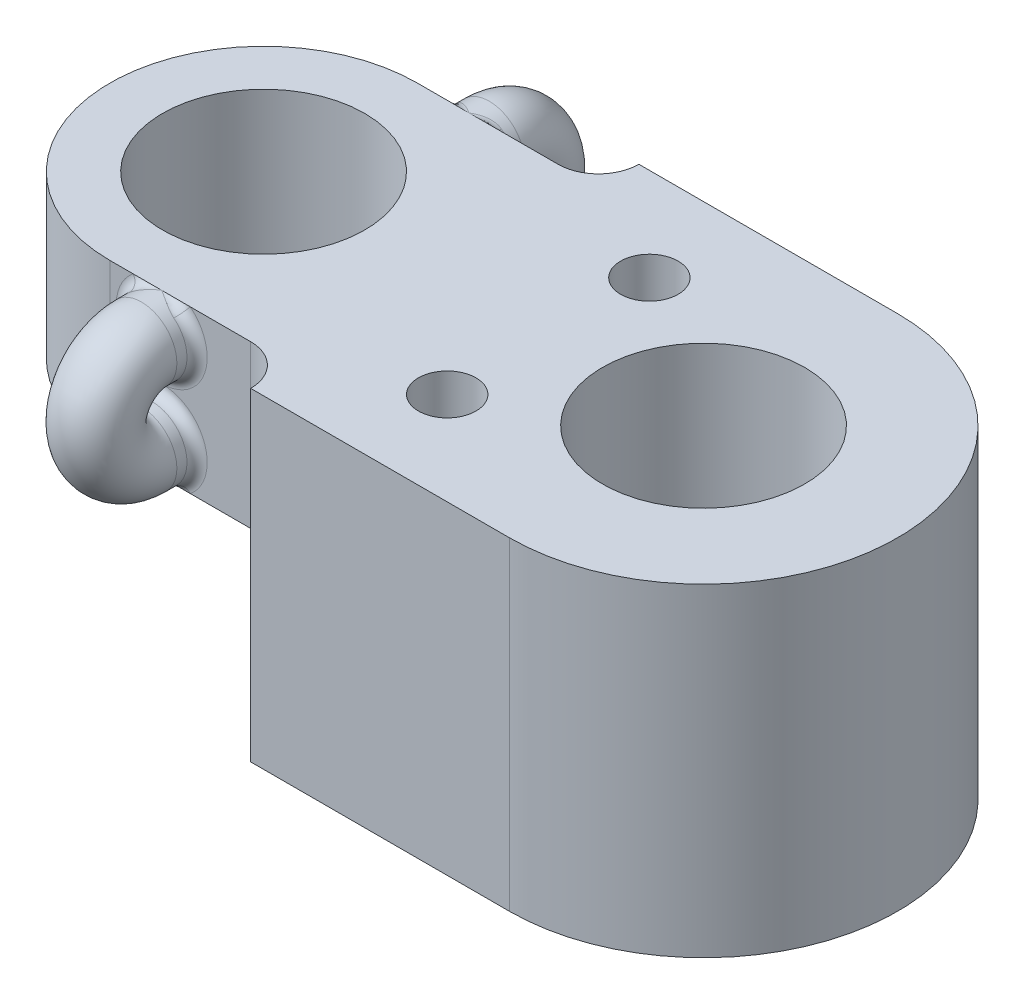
ISO-10303-21;
HEADER;
FILE_DESCRIPTION(('STEP AP214'),'2;1');
FILE_NAME('part.step','',(''),(''),'','','');
FILE_SCHEMA(('AUTOMOTIVE_DESIGN { 1 0 10303 214 1 1 1 1 }'));
ENDSEC;
DATA;
#1=APPLICATION_CONTEXT('core data for automotive mechanical design processes');
#2=APPLICATION_PROTOCOL_DEFINITION('international standard','automotive_design',2000,#1);
#3=PRODUCT_CONTEXT('',#1,'mechanical');
#4=PRODUCT('Part','Part','',(#3));
#5=PRODUCT_RELATED_PRODUCT_CATEGORY('part','',(#4));
#6=PRODUCT_DEFINITION_FORMATION('','',#4);
#7=PRODUCT_DEFINITION_CONTEXT('part definition',#1,'design');
#8=PRODUCT_DEFINITION('design','',#6,#7);
#9=PRODUCT_DEFINITION_SHAPE('','',#8);
#10=(LENGTH_UNIT() NAMED_UNIT(*) SI_UNIT(.MILLI.,.METRE.));
#11=(NAMED_UNIT(*) PLANE_ANGLE_UNIT() SI_UNIT($,.RADIAN.));
#12=(NAMED_UNIT(*) SI_UNIT($,.STERADIAN.) SOLID_ANGLE_UNIT());
#13=UNCERTAINTY_MEASURE_WITH_UNIT(LENGTH_MEASURE(1.E-05),#10,'distance_accuracy_value','');
#14=(GEOMETRIC_REPRESENTATION_CONTEXT(3) GLOBAL_UNCERTAINTY_ASSIGNED_CONTEXT((#13)) GLOBAL_UNIT_ASSIGNED_CONTEXT((#10,
#11,#12)) REPRESENTATION_CONTEXT('',''));
#15=CARTESIAN_POINT('',(0.,0.,0.));
#16=DIRECTION('',(0.,0.,1.));
#17=DIRECTION('',(1.,0.,0.));
#18=AXIS2_PLACEMENT_3D('',#15,#16,#17);
#19=CARTESIAN_POINT('',(-1.524,12.7,6.0325));
#20=DIRECTION('',(0.,0.,-1.));
#21=DIRECTION('',(-1.,0.,0.));
#22=AXIS2_PLACEMENT_3D('',#19,#20,#21);
#23=PLANE('',#22);
#24=DIRECTION('',(1.,0.,0.));
#25=VECTOR('',#24,1.);
#26=CARTESIAN_POINT('',(-1.524,6.35,6.0325));
#27=LINE('',#26,#25);
#28=CARTESIAN_POINT('',(-8.636,6.35,6.0325));
#29=VERTEX_POINT('',#28);
#30=CARTESIAN_POINT('',(-7.72653201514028,6.35,6.0325));
#31=VERTEX_POINT('',#30);
#32=EDGE_CURVE('E457',#29,#31,#27,.T.);
#33=ORIENTED_EDGE('',*,*,#32,.T.);
#34=CARTESIAN_POINT('',(-6.604,7.7390625,6.0325));
#35=DIRECTION('',(0.,0.,-1.));
#36=DIRECTION('',(-1.,0.,0.));
#37=AXIS2_PLACEMENT_3D('',#34,#35,#36);
#38=CIRCLE('',#37,1.78593750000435);
#39=CARTESIAN_POINT('',(-6.604,9.52500000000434,6.0325));
#40=VERTEX_POINT('',#39);
#41=EDGE_CURVE('E995',#31,#40,#38,.T.);
#42=ORIENTED_EDGE('',*,*,#41,.T.);
#43=CARTESIAN_POINT('',(-6.604,11.3109375,6.0325));
#44=DIRECTION('',(0.,0.,-1.));
#45=DIRECTION('',(-1.,0.,0.));
#46=AXIS2_PLACEMENT_3D('',#43,#44,#45);
#47=CIRCLE('',#46,1.78593750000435);
#48=CARTESIAN_POINT('',(-7.72653201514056,12.7,6.0325));
#49=VERTEX_POINT('',#48);
#50=EDGE_CURVE('E211',#40,#49,#47,.T.);
#51=ORIENTED_EDGE('',*,*,#50,.T.);
#52=DIRECTION('',(1.,0.,0.));
#53=VECTOR('',#52,1.);
#54=CARTESIAN_POINT('',(-1.524,12.7,6.0325));
#55=LINE('',#54,#53);
#56=CARTESIAN_POINT('',(-8.636,12.7,6.0325));
#57=VERTEX_POINT('',#56);
#58=EDGE_CURVE('E575',#57,#49,#55,.T.);
#59=ORIENTED_EDGE('',*,*,#58,.F.);
#60=DIRECTION('',(0.,-1.,0.));
#61=VECTOR('',#60,1.);
#62=CARTESIAN_POINT('',(-8.636,12.7,6.0325));
#63=LINE('',#62,#61);
#64=EDGE_CURVE('E579',#57,#29,#63,.T.);
#65=ORIENTED_EDGE('',*,*,#64,.T.);
#66=EDGE_LOOP('',(#33,#42,#51,#59,#65));
#67=FACE_BOUND('',#66,.T.);
#68=ADVANCED_FACE('F40',(#67),#23,.F.);
#69=CARTESIAN_POINT('',(-1.524,12.7,-6.0325));
#70=DIRECTION('',(0.,0.,1.));
#71=DIRECTION('',(1.,0.,0.));
#72=AXIS2_PLACEMENT_3D('',#69,#70,#71);
#73=PLANE('',#72);
#74=DIRECTION('',(-1.,0.,0.));
#75=VECTOR('',#74,1.);
#76=CARTESIAN_POINT('',(-1.524,12.7,-6.0325));
#77=LINE('',#76,#75);
#78=CARTESIAN_POINT('',(-7.72653201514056,12.7,-6.0325));
#79=VERTEX_POINT('',#78);
#80=CARTESIAN_POINT('',(-8.636,12.7,-6.0325));
#81=VERTEX_POINT('',#80);
#82=EDGE_CURVE('E555',#79,#81,#77,.T.);
#83=ORIENTED_EDGE('',*,*,#82,.F.);
#84=CARTESIAN_POINT('',(-6.604,11.3109375,-6.0325));
#85=DIRECTION('',(0.,0.,1.));
#86=DIRECTION('',(1.,0.,0.));
#87=AXIS2_PLACEMENT_3D('',#84,#85,#86);
#88=CIRCLE('',#87,1.78593750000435);
#89=CARTESIAN_POINT('',(-6.604,9.52499999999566,-6.0325));
#90=VERTEX_POINT('',#89);
#91=EDGE_CURVE('E536',#79,#90,#88,.T.);
#92=ORIENTED_EDGE('',*,*,#91,.T.);
#93=CARTESIAN_POINT('',(-6.604,7.7390625,-6.0325));
#94=DIRECTION('',(0.,0.,1.));
#95=DIRECTION('',(1.,0.,0.));
#96=AXIS2_PLACEMENT_3D('',#93,#94,#95);
#97=CIRCLE('',#96,1.78593750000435);
#98=CARTESIAN_POINT('',(-7.72653201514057,6.35,-6.0325));
#99=VERTEX_POINT('',#98);
#100=EDGE_CURVE('E532',#90,#99,#97,.T.);
#101=ORIENTED_EDGE('',*,*,#100,.T.);
#102=DIRECTION('',(-1.,0.,0.));
#103=VECTOR('',#102,1.);
#104=CARTESIAN_POINT('',(-1.524,6.35,-6.0325));
#105=LINE('',#104,#103);
#106=CARTESIAN_POINT('',(-8.636,6.35,-6.0325));
#107=VERTEX_POINT('',#106);
#108=EDGE_CURVE('E201',#99,#107,#105,.T.);
#109=ORIENTED_EDGE('',*,*,#108,.T.);
#110=DIRECTION('',(0.,-1.,0.));
#111=VECTOR('',#110,1.);
#112=CARTESIAN_POINT('',(-8.636,12.7,-6.0325));
#113=LINE('',#112,#111);
#114=EDGE_CURVE('E558',#81,#107,#113,.T.);
#115=ORIENTED_EDGE('',*,*,#114,.F.);
#116=EDGE_LOOP('',(#83,#92,#101,#109,#115));
#117=FACE_BOUND('',#116,.T.);
#118=ADVANCED_FACE('F431',(#117),#73,.F.);
#119=CARTESIAN_POINT('',(-3.1115,12.7,-6.0325));
#120=VERTEX_POINT('',#119);
#121=CARTESIAN_POINT('',(-5.48146798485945,12.7,-6.0325));
#122=VERTEX_POINT('',#121);
#123=EDGE_CURVE('E566',#120,#122,#77,.T.);
#124=ORIENTED_EDGE('',*,*,#123,.F.);
#125=DIRECTION('',(0.,-1.,0.));
#126=VECTOR('',#125,1.);
#127=CARTESIAN_POINT('',(-3.1115,6.35,-6.0325));
#128=LINE('',#127,#126);
#129=CARTESIAN_POINT('',(-3.1115,6.35,-6.0325));
#130=VERTEX_POINT('',#129);
#131=EDGE_CURVE('E414',#120,#130,#128,.T.);
#132=ORIENTED_EDGE('',*,*,#131,.T.);
#133=CARTESIAN_POINT('',(-5.48146798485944,6.35,-6.0325));
#134=VERTEX_POINT('',#133);
#135=EDGE_CURVE('E205',#130,#134,#105,.T.);
#136=ORIENTED_EDGE('',*,*,#135,.T.);
#137=CARTESIAN_POINT('',(-6.604,7.7390625,-6.0325));
#138=DIRECTION('',(0.,0.,1.));
#139=DIRECTION('',(1.,0.,0.));
#140=AXIS2_PLACEMENT_3D('',#137,#138,#139);
#141=CIRCLE('',#140,1.78593750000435);
#142=EDGE_CURVE('E531',#134,#90,#141,.T.);
#143=ORIENTED_EDGE('',*,*,#142,.T.);
#144=CARTESIAN_POINT('',(-6.604,11.3109375,-6.0325));
#145=DIRECTION('',(0.,0.,1.));
#146=DIRECTION('',(1.,0.,0.));
#147=AXIS2_PLACEMENT_3D('',#144,#145,#146);
#148=CIRCLE('',#147,1.78593750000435);
#149=EDGE_CURVE('E534',#90,#122,#148,.T.);
#150=ORIENTED_EDGE('',*,*,#149,.T.);
#151=EDGE_LOOP('',(#124,#132,#136,#143,#150));
#152=FACE_BOUND('',#151,.T.);
#153=ADVANCED_FACE('F302',(#152),#73,.F.);
#154=CARTESIAN_POINT('',(-5.48146798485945,6.35,6.0325));
#155=VERTEX_POINT('',#154);
#156=CARTESIAN_POINT('',(-3.1115,6.35,6.0325));
#157=VERTEX_POINT('',#156);
#158=EDGE_CURVE('E447',#155,#157,#27,.T.);
#159=ORIENTED_EDGE('',*,*,#158,.T.);
#160=DIRECTION('',(0.,-1.,0.));
#161=VECTOR('',#160,1.);
#162=CARTESIAN_POINT('',(-3.1115,12.7,6.0325));
#163=LINE('',#162,#161);
#164=CARTESIAN_POINT('',(-3.1115,12.7,6.0325));
#165=VERTEX_POINT('',#164);
#166=EDGE_CURVE('E57',#157,#165,#163,.F.);
#167=ORIENTED_EDGE('',*,*,#166,.T.);
#168=CARTESIAN_POINT('',(-5.48146798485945,12.7,6.0325));
#169=VERTEX_POINT('',#168);
#170=EDGE_CURVE('E570',#169,#165,#55,.T.);
#171=ORIENTED_EDGE('',*,*,#170,.F.);
#172=CARTESIAN_POINT('',(-6.604,11.3109375,6.0325));
#173=DIRECTION('',(0.,0.,-1.));
#174=DIRECTION('',(-1.,0.,0.));
#175=AXIS2_PLACEMENT_3D('',#172,#173,#174);
#176=CIRCLE('',#175,1.78593750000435);
#177=EDGE_CURVE('E213',#169,#40,#176,.T.);
#178=ORIENTED_EDGE('',*,*,#177,.T.);
#179=CARTESIAN_POINT('',(-6.604,7.7390625,6.0325));
#180=DIRECTION('',(0.,0.,-1.));
#181=DIRECTION('',(-1.,0.,0.));
#182=AXIS2_PLACEMENT_3D('',#179,#180,#181);
#183=CIRCLE('',#182,1.78593750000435);
#184=EDGE_CURVE('E450',#40,#155,#183,.T.);
#185=ORIENTED_EDGE('',*,*,#184,.T.);
#186=EDGE_LOOP('',(#159,#167,#171,#178,#185));
#187=FACE_BOUND('',#186,.T.);
#188=ADVANCED_FACE('F334',(#187),#23,.F.);
#189=CARTESIAN_POINT('',(0.,12.7,7.62));
#190=DIRECTION('',(0.,0.,-1.));
#191=DIRECTION('',(-1.,0.,0.));
#192=AXIS2_PLACEMENT_3D('',#189,#190,#191);
#193=PLANE('',#192);
#194=DIRECTION('',(1.,0.,0.));
#195=VECTOR('',#194,1.);
#196=CARTESIAN_POINT('',(0.,12.7,7.62));
#197=LINE('',#196,#195);
#198=CARTESIAN_POINT('',(-1.524,12.7,7.62));
#199=VERTEX_POINT('',#198);
#200=CARTESIAN_POINT('',(8.636,12.7,7.62));
#201=VERTEX_POINT('',#200);
#202=EDGE_CURVE('E617',#199,#201,#197,.T.);
#203=ORIENTED_EDGE('',*,*,#202,.F.);
#204=DIRECTION('',(0.,-1.,0.));
#205=VECTOR('',#204,1.);
#206=CARTESIAN_POINT('',(-1.524,6.35,7.62));
#207=LINE('',#206,#205);
#208=CARTESIAN_POINT('',(-1.524,4.7625,7.62));
#209=VERTEX_POINT('',#208);
#210=EDGE_CURVE('E604',#199,#209,#207,.T.);
#211=ORIENTED_EDGE('',*,*,#210,.T.);
#212=CARTESIAN_POINT('',(-1.524,0.,7.62));
#213=VERTEX_POINT('',#212);
#214=EDGE_CURVE('E608',#209,#213,#207,.T.);
#215=ORIENTED_EDGE('',*,*,#214,.T.);
#216=DIRECTION('',(1.,0.,0.));
#217=VECTOR('',#216,1.);
#218=CARTESIAN_POINT('',(0.,0.,7.62));
#219=LINE('',#218,#217);
#220=CARTESIAN_POINT('',(8.636,0.,7.62));
#221=VERTEX_POINT('',#220);
#222=EDGE_CURVE('E614',#213,#221,#219,.T.);
#223=ORIENTED_EDGE('',*,*,#222,.T.);
#224=DIRECTION('',(0.,-1.,0.));
#225=VECTOR('',#224,1.);
#226=CARTESIAN_POINT('',(8.636,12.7,7.62));
#227=LINE('',#226,#225);
#228=EDGE_CURVE('E538',#201,#221,#227,.T.);
#229=ORIENTED_EDGE('',*,*,#228,.F.);
#230=EDGE_LOOP('',(#203,#211,#215,#223,#229));
#231=FACE_BOUND('',#230,.T.);
#232=ADVANCED_FACE('F439',(#231),#193,.F.);
#233=CARTESIAN_POINT('',(8.636,12.7,0.));
#234=DIRECTION('',(0.,-1.,0.));
#235=DIRECTION('',(0.,0.,-1.));
#236=AXIS2_PLACEMENT_3D('',#233,#234,#235);
#237=CYLINDRICAL_SURFACE('',#236,7.62);
#238=CARTESIAN_POINT('',(8.636,0.,0.));
#239=DIRECTION('',(0.,1.,0.));
#240=DIRECTION('',(0.,0.,1.));
#241=AXIS2_PLACEMENT_3D('',#238,#239,#240);
#242=CIRCLE('',#241,7.62);
#243=CARTESIAN_POINT('',(8.636,0.,-7.62));
#244=VERTEX_POINT('',#243);
#245=EDGE_CURVE('E627',#244,#221,#242,.F.);
#246=ORIENTED_EDGE('',*,*,#245,.F.);
#247=DIRECTION('',(0.,-1.,0.));
#248=VECTOR('',#247,1.);
#249=CARTESIAN_POINT('',(8.636,12.7,-7.62));
#250=LINE('',#249,#248);
#251=CARTESIAN_POINT('',(8.636,12.7,-7.62));
#252=VERTEX_POINT('',#251);
#253=EDGE_CURVE('E625',#252,#244,#250,.T.);
#254=ORIENTED_EDGE('',*,*,#253,.F.);
#255=CARTESIAN_POINT('',(8.636,12.7,0.));
#256=DIRECTION('',(0.,1.,0.));
#257=DIRECTION('',(0.,0.,1.));
#258=AXIS2_PLACEMENT_3D('',#255,#256,#257);
#259=CIRCLE('',#258,7.62);
#260=EDGE_CURVE('E619',#252,#201,#259,.F.);
#261=ORIENTED_EDGE('',*,*,#260,.T.);
#262=ORIENTED_EDGE('',*,*,#228,.T.);
#263=EDGE_LOOP('',(#246,#254,#261,#262));
#264=FACE_BOUND('',#263,.T.);
#265=ADVANCED_FACE('F444',(#264),#237,.T.);
#266=CARTESIAN_POINT('',(0.,12.7,-7.62));
#267=DIRECTION('',(0.,0.,-1.));
#268=DIRECTION('',(-1.,0.,0.));
#269=AXIS2_PLACEMENT_3D('',#266,#267,#268);
#270=PLANE('',#269);
#271=DIRECTION('',(0.,-1.,0.));
#272=VECTOR('',#271,1.);
#273=CARTESIAN_POINT('',(-1.524,6.35,-7.62));
#274=LINE('',#273,#272);
#275=CARTESIAN_POINT('',(-1.524,12.7,-7.62));
#276=VERTEX_POINT('',#275);
#277=CARTESIAN_POINT('',(-1.524,4.7625,-7.62));
#278=VERTEX_POINT('',#277);
#279=EDGE_CURVE('E609',#276,#278,#274,.T.);
#280=ORIENTED_EDGE('',*,*,#279,.F.);
#281=DIRECTION('',(1.,0.,0.));
#282=VECTOR('',#281,1.);
#283=CARTESIAN_POINT('',(0.,12.7,-7.62));
#284=LINE('',#283,#282);
#285=EDGE_CURVE('E623',#276,#252,#284,.T.);
#286=ORIENTED_EDGE('',*,*,#285,.T.);
#287=ORIENTED_EDGE('',*,*,#253,.T.);
#288=DIRECTION('',(1.,0.,0.));
#289=VECTOR('',#288,1.);
#290=CARTESIAN_POINT('',(0.,0.,-7.62));
#291=LINE('',#290,#289);
#292=CARTESIAN_POINT('',(-1.524,0.,-7.62));
#293=VERTEX_POINT('',#292);
#294=EDGE_CURVE('E620',#293,#244,#291,.T.);
#295=ORIENTED_EDGE('',*,*,#294,.F.);
#296=EDGE_CURVE('E603',#278,#293,#274,.T.);
#297=ORIENTED_EDGE('',*,*,#296,.F.);
#298=EDGE_LOOP('',(#280,#286,#287,#295,#297));
#299=FACE_BOUND('',#298,.T.);
#300=ADVANCED_FACE('F645',(#299),#270,.T.);
#301=CARTESIAN_POINT('',(0.,12.7,0.));
#302=DIRECTION('',(0.,1.,0.));
#303=DIRECTION('',(0.,0.,1.));
#304=AXIS2_PLACEMENT_3D('',#301,#302,#303);
#305=PLANE('',#304);
#306=ORIENTED_EDGE('',*,*,#170,.T.);
#307=CARTESIAN_POINT('',(-3.1115,12.7,7.62));
#308=DIRECTION('',(0.,1.,0.));
#309=DIRECTION('',(0.,0.,1.));
#310=AXIS2_PLACEMENT_3D('',#307,#308,#309);
#311=CIRCLE('',#310,1.5875);
#312=EDGE_CURVE('E11',#165,#199,#311,.F.);
#313=ORIENTED_EDGE('',*,*,#312,.T.);
#314=ORIENTED_EDGE('',*,*,#202,.T.);
#315=ORIENTED_EDGE('',*,*,#260,.F.);
#316=ORIENTED_EDGE('',*,*,#285,.F.);
#317=CARTESIAN_POINT('',(-3.1115,12.7,-7.62));
#318=DIRECTION('',(0.,1.,0.));
#319=DIRECTION('',(0.,0.,1.));
#320=AXIS2_PLACEMENT_3D('',#317,#318,#319);
#321=CIRCLE('',#320,1.5875);
#322=EDGE_CURVE('E49',#276,#120,#321,.F.);
#323=ORIENTED_EDGE('',*,*,#322,.T.);
#324=ORIENTED_EDGE('',*,*,#123,.T.);
#325=CARTESIAN_POINT('',(-6.604,12.7,-6.0325));
#326=VERTEX_POINT('',#325);
#327=EDGE_CURVE('E552',#122,#326,#77,.T.);
#328=ORIENTED_EDGE('',*,*,#327,.T.);
#329=EDGE_CURVE('E562',#326,#79,#77,.T.);
#330=ORIENTED_EDGE('',*,*,#329,.T.);
#331=ORIENTED_EDGE('',*,*,#82,.T.);
#332=CARTESIAN_POINT('',(-8.636,12.7,0.));
#333=DIRECTION('',(0.,1.,0.));
#334=DIRECTION('',(0.,0.,-1.));
#335=AXIS2_PLACEMENT_3D('',#332,#333,#334);
#336=CIRCLE('',#335,6.0325);
#337=EDGE_CURVE('E569',#81,#57,#336,.T.);
#338=ORIENTED_EDGE('',*,*,#337,.T.);
#339=ORIENTED_EDGE('',*,*,#58,.T.);
#340=CARTESIAN_POINT('',(-6.604,12.7000000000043,6.0325));
#341=VERTEX_POINT('',#340);
#342=EDGE_CURVE('E574',#49,#341,#55,.T.);
#343=ORIENTED_EDGE('',*,*,#342,.T.);
#344=EDGE_CURVE('E572',#341,#169,#55,.T.);
#345=ORIENTED_EDGE('',*,*,#344,.T.);
#346=EDGE_LOOP('',(#306,#313,#314,#315,#316,#323,#324,#328,#330,#331,#338,#339,#343,#345));
#347=FACE_BOUND('',#346,.T.);
#348=CARTESIAN_POINT('',(2.54,12.7,3.96875));
#349=DIRECTION('',(0.,-1.,0.));
#350=DIRECTION('',(0.,0.,-1.));
#351=AXIS2_PLACEMENT_3D('',#348,#349,#350);
#352=CIRCLE('',#351,1.1303);
#353=CARTESIAN_POINT('',(2.54,12.7,2.83845));
#354=VERTEX_POINT('',#353);
#355=EDGE_CURVE('E585',#354,#354,#352,.T.);
#356=ORIENTED_EDGE('',*,*,#355,.T.);
#357=EDGE_LOOP('',(#356));
#358=FACE_BOUND('',#357,.T.);
#359=CARTESIAN_POINT('',(2.54,12.7,-3.96875));
#360=DIRECTION('',(0.,-1.,0.));
#361=DIRECTION('',(0.,0.,-1.));
#362=AXIS2_PLACEMENT_3D('',#359,#360,#361);
#363=CIRCLE('',#362,1.1303);
#364=CARTESIAN_POINT('',(2.54,12.7,-5.09905));
#365=VERTEX_POINT('',#364);
#366=EDGE_CURVE('E591',#365,#365,#363,.T.);
#367=ORIENTED_EDGE('',*,*,#366,.T.);
#368=EDGE_LOOP('',(#367));
#369=FACE_BOUND('',#368,.T.);
#370=CARTESIAN_POINT('',(-8.636,12.7,0.));
#371=DIRECTION('',(0.,-1.,0.));
#372=DIRECTION('',(0.,0.,-1.));
#373=AXIS2_PLACEMENT_3D('',#370,#371,#372);
#374=CIRCLE('',#373,3.96875);
#375=CARTESIAN_POINT('',(-8.636,12.7,-3.96875));
#376=VERTEX_POINT('',#375);
#377=EDGE_CURVE('E595',#376,#376,#374,.T.);
#378=ORIENTED_EDGE('',*,*,#377,.T.);
#379=EDGE_LOOP('',(#378));
#380=FACE_BOUND('',#379,.T.);
#381=CARTESIAN_POINT('',(8.636,12.7,0.));
#382=DIRECTION('',(0.,-1.,0.));
#383=DIRECTION('',(0.,0.,-1.));
#384=AXIS2_PLACEMENT_3D('',#381,#382,#383);
#385=CIRCLE('',#384,3.96875);
#386=CARTESIAN_POINT('',(8.636,12.7,-3.96875));
#387=VERTEX_POINT('',#386);
#388=EDGE_CURVE('E611',#387,#387,#385,.T.);
#389=ORIENTED_EDGE('',*,*,#388,.T.);
#390=EDGE_LOOP('',(#389));
#391=FACE_BOUND('',#390,.T.);
#392=ADVANCED_FACE('F564',(#347,#358,#369,#380,#391),#305,.T.);
#393=CARTESIAN_POINT('',(0.,0.,0.));
#394=DIRECTION('',(0.,1.,0.));
#395=DIRECTION('',(0.,0.,1.));
#396=AXIS2_PLACEMENT_3D('',#393,#394,#395);
#397=PLANE('',#396);
#398=CARTESIAN_POINT('',(2.54,0.,3.96875));
#399=DIRECTION('',(0.,-1.,0.));
#400=DIRECTION('',(0.,0.,-1.));
#401=AXIS2_PLACEMENT_3D('',#398,#399,#400);
#402=CIRCLE('',#401,1.1303);
#403=CARTESIAN_POINT('',(2.54,0.,2.83845));
#404=VERTEX_POINT('',#403);
#405=EDGE_CURVE('E581',#404,#404,#402,.T.);
#406=ORIENTED_EDGE('',*,*,#405,.F.);
#407=EDGE_LOOP('',(#406));
#408=FACE_BOUND('',#407,.T.);
#409=CARTESIAN_POINT('',(2.54,0.,-3.96875));
#410=DIRECTION('',(0.,-1.,0.));
#411=DIRECTION('',(0.,0.,-1.));
#412=AXIS2_PLACEMENT_3D('',#409,#410,#411);
#413=CIRCLE('',#412,1.1303);
#414=CARTESIAN_POINT('',(2.54,0.,-5.09905));
#415=VERTEX_POINT('',#414);
#416=EDGE_CURVE('E588',#415,#415,#413,.T.);
#417=ORIENTED_EDGE('',*,*,#416,.F.);
#418=EDGE_LOOP('',(#417));
#419=FACE_BOUND('',#418,.T.);
#420=CARTESIAN_POINT('',(8.636,0.,0.));
#421=DIRECTION('',(0.,-1.,0.));
#422=DIRECTION('',(0.,0.,-1.));
#423=AXIS2_PLACEMENT_3D('',#420,#421,#422);
#424=CIRCLE('',#423,3.96875);
#425=CARTESIAN_POINT('',(8.636,0.,-3.96875));
#426=VERTEX_POINT('',#425);
#427=EDGE_CURVE('E607',#426,#426,#424,.T.);
#428=ORIENTED_EDGE('',*,*,#427,.F.);
#429=EDGE_LOOP('',(#428));
#430=FACE_BOUND('',#429,.T.);
#431=ORIENTED_EDGE('',*,*,#222,.F.);
#432=DIRECTION('',(0.,0.,1.));
#433=VECTOR('',#432,1.);
#434=CARTESIAN_POINT('',(-1.524,0.,7.62));
#435=LINE('',#434,#433);
#436=EDGE_CURVE('E598',#293,#213,#435,.T.);
#437=ORIENTED_EDGE('',*,*,#436,.F.);
#438=ORIENTED_EDGE('',*,*,#294,.T.);
#439=ORIENTED_EDGE('',*,*,#245,.T.);
#440=EDGE_LOOP('',(#431,#437,#438,#439));
#441=FACE_BOUND('',#440,.T.);
#442=ADVANCED_FACE('F641',(#408,#419,#430,#441),#397,.F.);
#443=CARTESIAN_POINT('',(8.636,12.7,0.));
#444=DIRECTION('',(0.,-1.,0.));
#445=DIRECTION('',(0.,0.,-1.));
#446=AXIS2_PLACEMENT_3D('',#443,#444,#445);
#447=CYLINDRICAL_SURFACE('',#446,3.96875);
#448=ORIENTED_EDGE('',*,*,#388,.F.);
#449=EDGE_LOOP('',(#448));
#450=FACE_BOUND('',#449,.T.);
#451=ORIENTED_EDGE('',*,*,#427,.T.);
#452=EDGE_LOOP('',(#451));
#453=FACE_BOUND('',#452,.T.);
#454=ADVANCED_FACE('F649',(#450,#453),#447,.F.);
#455=CARTESIAN_POINT('',(-1.524,6.35,7.62));
#456=DIRECTION('',(1.,0.,0.));
#457=DIRECTION('',(0.,0.,-1.));
#458=AXIS2_PLACEMENT_3D('',#455,#456,#457);
#459=PLANE('',#458);
#460=ORIENTED_EDGE('',*,*,#214,.F.);
#461=DIRECTION('',(0.,0.,1.));
#462=VECTOR('',#461,1.);
#463=CARTESIAN_POINT('',(-1.524,4.7625,7.62));
#464=LINE('',#463,#462);
#465=EDGE_CURVE('E465',#209,#278,#464,.F.);
#466=ORIENTED_EDGE('',*,*,#465,.T.);
#467=ORIENTED_EDGE('',*,*,#296,.T.);
#468=ORIENTED_EDGE('',*,*,#436,.T.);
#469=EDGE_LOOP('',(#460,#466,#467,#468));
#470=FACE_BOUND('',#469,.T.);
#471=ADVANCED_FACE('F311',(#470),#459,.F.);
#472=CARTESIAN_POINT('',(-8.636,6.35,0.));
#473=DIRECTION('',(0.,-1.,0.));
#474=DIRECTION('',(0.,0.,-1.));
#475=AXIS2_PLACEMENT_3D('',#472,#473,#474);
#476=PLANE('',#475);
#477=ORIENTED_EDGE('',*,*,#135,.F.);
#478=DIRECTION('',(0.,0.,1.));
#479=VECTOR('',#478,1.);
#480=CARTESIAN_POINT('',(-3.1115,6.35,0.));
#481=LINE('',#480,#479);
#482=EDGE_CURVE('E65',#130,#157,#481,.T.);
#483=ORIENTED_EDGE('',*,*,#482,.T.);
#484=ORIENTED_EDGE('',*,*,#158,.F.);
#485=CARTESIAN_POINT('',(-6.604,6.35,6.0325));
#486=VERTEX_POINT('',#485);
#487=EDGE_CURVE('E453',#486,#155,#27,.T.);
#488=ORIENTED_EDGE('',*,*,#487,.F.);
#489=EDGE_CURVE('E456',#31,#486,#27,.T.);
#490=ORIENTED_EDGE('',*,*,#489,.F.);
#491=ORIENTED_EDGE('',*,*,#32,.F.);
#492=CARTESIAN_POINT('',(-8.636,6.35,0.));
#493=DIRECTION('',(0.,1.,0.));
#494=DIRECTION('',(0.,0.,-1.));
#495=AXIS2_PLACEMENT_3D('',#492,#493,#494);
#496=CIRCLE('',#495,6.0325);
#497=EDGE_CURVE('E454',#107,#29,#496,.T.);
#498=ORIENTED_EDGE('',*,*,#497,.F.);
#499=ORIENTED_EDGE('',*,*,#108,.F.);
#500=CARTESIAN_POINT('',(-6.604,6.34999999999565,-6.03249999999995));
#501=VERTEX_POINT('',#500);
#502=EDGE_CURVE('E196',#501,#99,#105,.T.);
#503=ORIENTED_EDGE('',*,*,#502,.F.);
#504=EDGE_CURVE('E199',#134,#501,#105,.T.);
#505=ORIENTED_EDGE('',*,*,#504,.F.);
#506=EDGE_LOOP('',(#477,#483,#484,#488,#490,#491,#498,#499,#503,#505));
#507=FACE_BOUND('',#506,.T.);
#508=CARTESIAN_POINT('',(-8.636,6.35,0.));
#509=DIRECTION('',(0.,-1.,0.));
#510=DIRECTION('',(0.,0.,-1.));
#511=AXIS2_PLACEMENT_3D('',#508,#509,#510);
#512=CIRCLE('',#511,3.96875);
#513=CARTESIAN_POINT('',(-8.636,6.35,-3.96875));
#514=VERTEX_POINT('',#513);
#515=EDGE_CURVE('E594',#514,#514,#512,.T.);
#516=ORIENTED_EDGE('',*,*,#515,.F.);
#517=EDGE_LOOP('',(#516));
#518=FACE_BOUND('',#517,.T.);
#519=ADVANCED_FACE('F197',(#507,#518),#476,.T.);
#520=CARTESIAN_POINT('',(-8.636,12.7,0.));
#521=DIRECTION('',(0.,-1.,0.));
#522=DIRECTION('',(0.,0.,-1.));
#523=AXIS2_PLACEMENT_3D('',#520,#521,#522);
#524=CYLINDRICAL_SURFACE('',#523,3.96875);
#525=ORIENTED_EDGE('',*,*,#377,.F.);
#526=EDGE_LOOP('',(#525));
#527=FACE_BOUND('',#526,.T.);
#528=ORIENTED_EDGE('',*,*,#515,.T.);
#529=EDGE_LOOP('',(#528));
#530=FACE_BOUND('',#529,.T.);
#531=ADVANCED_FACE('F310',(#527,#530),#524,.F.);
#532=CARTESIAN_POINT('',(2.54,0.,-3.96875));
#533=DIRECTION('',(0.,-1.,0.));
#534=DIRECTION('',(0.,0.,-1.));
#535=AXIS2_PLACEMENT_3D('',#532,#533,#534);
#536=CYLINDRICAL_SURFACE('',#535,1.1303);
#537=ORIENTED_EDGE('',*,*,#366,.F.);
#538=EDGE_LOOP('',(#537));
#539=FACE_BOUND('',#538,.T.);
#540=ORIENTED_EDGE('',*,*,#416,.T.);
#541=EDGE_LOOP('',(#540));
#542=FACE_BOUND('',#541,.T.);
#543=ADVANCED_FACE('F697',(#539,#542),#536,.F.);
#544=CARTESIAN_POINT('',(2.54,0.,3.96875));
#545=DIRECTION('',(0.,-1.,0.));
#546=DIRECTION('',(0.,0.,-1.));
#547=AXIS2_PLACEMENT_3D('',#544,#545,#546);
#548=CYLINDRICAL_SURFACE('',#547,1.1303);
#549=ORIENTED_EDGE('',*,*,#355,.F.);
#550=EDGE_LOOP('',(#549));
#551=FACE_BOUND('',#550,.T.);
#552=ORIENTED_EDGE('',*,*,#405,.T.);
#553=EDGE_LOOP('',(#552));
#554=FACE_BOUND('',#553,.T.);
#555=ADVANCED_FACE('F702',(#551,#554),#548,.F.);
#556=CARTESIAN_POINT('',(-8.636,12.7,0.));
#557=DIRECTION('',(0.,-1.,0.));
#558=DIRECTION('',(0.,0.,-1.));
#559=AXIS2_PLACEMENT_3D('',#556,#557,#558);
#560=CYLINDRICAL_SURFACE('',#559,6.0325);
#561=ORIENTED_EDGE('',*,*,#497,.T.);
#562=ORIENTED_EDGE('',*,*,#64,.F.);
#563=ORIENTED_EDGE('',*,*,#337,.F.);
#564=ORIENTED_EDGE('',*,*,#114,.T.);
#565=EDGE_LOOP('',(#561,#562,#563,#564));
#566=FACE_BOUND('',#565,.T.);
#567=ADVANCED_FACE('F711',(#566),#560,.T.);
#568=CARTESIAN_POINT('',(-6.604,7.7390625,6.82625));
#569=DIRECTION('',(0.,0.,-1.));
#570=DIRECTION('',(0.,1.,0.));
#571=AXIS2_PLACEMENT_3D('',#568,#569,#570);
#572=CYLINDRICAL_SURFACE('',#571,1.38906250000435);
#573=CARTESIAN_POINT('',(-6.604,7.7390625,6.82625));
#574=DIRECTION('',(0.,0.,-1.));
#575=DIRECTION('',(1.,0.,0.));
#576=AXIS2_PLACEMENT_3D('',#573,#574,#575);
#577=CIRCLE('',#576,1.38906250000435);
#578=CARTESIAN_POINT('',(-6.604,6.34999999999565,6.82625));
#579=VERTEX_POINT('',#578);
#580=EDGE_CURVE('E1008',#579,#579,#577,.T.);
#581=ORIENTED_EDGE('',*,*,#580,.T.);
#582=EDGE_LOOP('',(#581));
#583=FACE_BOUND('',#582,.T.);
#584=CARTESIAN_POINT('',(-7.60596119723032,6.77699785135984,6.39906321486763));
#585=CARTESIAN_POINT('',(-7.50249537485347,6.66924133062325,5.90001615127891));
#586=CARTESIAN_POINT('',(-7.89223582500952,6.35,6.0325));
#587=CARTESIAN_POINT('',(-7.58586283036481,6.75602278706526,6.41018540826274));
#588=CARTESIAN_POINT('',(-7.50643316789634,6.67767764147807,5.9236497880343));
#589=CARTESIAN_POINT('',(-7.86639506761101,6.35,6.0325));
#590=CARTESIAN_POINT('',(-7.56464488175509,6.73528217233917,6.41785741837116));
#591=CARTESIAN_POINT('',(-7.50576743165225,6.67962046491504,5.9482027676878));
#592=CARTESIAN_POINT('',(-7.83911484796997,6.35,6.0325));
#593=CARTESIAN_POINT('',(-7.52071458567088,6.69503900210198,6.4274924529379));
#594=CARTESIAN_POINT('',(-7.49622087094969,6.67418188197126,5.99394232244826));
#595=CARTESIAN_POINT('',(-7.78263303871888,6.35,6.0325));
#596=CARTESIAN_POINT('',(-7.49802017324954,6.67552577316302,6.42951430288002));
#597=CARTESIAN_POINT('',(-7.48783107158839,6.66735529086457,6.01530707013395));
#598=CARTESIAN_POINT('',(-7.75345450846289,6.35,6.0325));
#599=CARTESIAN_POINT('',(-7.43926074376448,6.62824495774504,6.42914397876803));
#600=CARTESIAN_POINT('',(-7.45880840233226,6.64393320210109,6.06178184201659));
#601=CARTESIAN_POINT('',(-7.67790667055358,6.35,6.0325));
#602=CARTESIAN_POINT('',(-7.40240989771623,6.60149709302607,6.42389060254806));
#603=CARTESIAN_POINT('',(-7.43428144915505,6.62425439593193,6.08469590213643));
#604=CARTESIAN_POINT('',(-7.63052701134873,6.35,6.0325));
#605=CARTESIAN_POINT('',(-7.32682835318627,6.55201763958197,6.40639471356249));
#606=CARTESIAN_POINT('',(-7.3756607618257,6.58218237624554,6.11838117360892));
#607=CARTESIAN_POINT('',(-7.53335073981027,6.35,6.0325));
#608=CARTESIAN_POINT('',(-7.28808671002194,6.52931417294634,6.39410558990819));
#609=CARTESIAN_POINT('',(-7.34179128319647,6.55974418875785,6.12989847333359));
#610=CARTESIAN_POINT('',(-7.48354005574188,6.35,6.0325));
#611=CARTESIAN_POINT('',(-7.18742116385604,6.476560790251,6.35642084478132));
#612=CARTESIAN_POINT('',(-7.24889055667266,6.50541141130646,6.14711253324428));
#613=CARTESIAN_POINT('',(-7.35411292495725,6.35,6.0325));
#614=CARTESIAN_POINT('',(-7.12469878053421,6.44954724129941,6.3275405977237));
#615=CARTESIAN_POINT('',(-7.18435938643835,6.47338913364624,6.14767163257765));
#616=CARTESIAN_POINT('',(-7.27346986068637,6.35,6.0325));
#617=CARTESIAN_POINT('',(-6.99804967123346,6.40537098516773,6.26331704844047));
#618=CARTESIAN_POINT('',(-7.04979598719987,6.42051671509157,6.13546359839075));
#619=CARTESIAN_POINT('',(-7.11063529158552,6.35,6.0325));
#620=CARTESIAN_POINT('',(-6.93412328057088,6.38820557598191,6.22797552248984));
#621=CARTESIAN_POINT('',(-6.97871552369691,6.3986552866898,6.12317801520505));
#622=CARTESIAN_POINT('',(-7.02844421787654,6.35,6.0325));
#623=CARTESIAN_POINT('',(-6.78357771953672,6.35886161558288,6.14131498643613));
#624=CARTESIAN_POINT('',(-6.81084283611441,6.36189146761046,6.08721270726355));
#625=CARTESIAN_POINT('',(-6.83488563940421,6.35,6.0325));
#626=CARTESIAN_POINT('',(-6.696658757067,6.35038360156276,6.08865915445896));
#627=CARTESIAN_POINT('',(-6.70993136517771,6.35050237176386,6.06058632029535));
#628=CARTESIAN_POINT('',(-6.72313268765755,6.35,6.0325));
#629=CARTESIAN_POINT('',(-6.60796406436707,6.35000424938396,6.03490257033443));
#630=CARTESIAN_POINT('',(-6.60853037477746,6.3500052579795,6.03370131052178));
#631=CARTESIAN_POINT('',(-6.60909665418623,6.35,6.0325));
#632=CARTESIAN_POINT('',(-6.60598197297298,6.35000000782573,6.03370124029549));
#633=CARTESIAN_POINT('',(-6.60626510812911,6.34999979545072,6.03310064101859));
#634=CARTESIAN_POINT('',(-6.60654825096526,6.35,6.0325));
#635=CARTESIAN_POINT('',(-6.604,6.34999999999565,6.0325));
#636=CARTESIAN_POINT('',(-6.604,6.34999999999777,6.0325));
#637=CARTESIAN_POINT('',(-6.604,6.35,6.0325));
#638=(BOUNDED_SURFACE() B_SPLINE_SURFACE(3,2,((#584,#585,#586),(#587,#588,#589),(#590,#591,
#592),(#593,#594,#595),(#596,#597,#598),(#599,#600,#601),(#602,#603,#604),(#605,#606,#607),
(#608,#609,#610),(#611,#612,#613),(#614,#615,#616),(#617,#618,#619),(#620,#621,#622),(#623,#624,
#625),(#626,#627,#628),(#629,#630,#631),(#632,#633,#634),(#635,#636,#637)),.UNSPECIFIED.,.F.,
.F.,.F.) B_SPLINE_SURFACE_WITH_KNOTS((4,2,2,2,2,2,2,2,4),(3,3),(0.,0.116384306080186,
0.231552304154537,0.406946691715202,0.583516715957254,0.859263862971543,1.13493531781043,
1.50467690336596,1.51312899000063),(0.,1.),
.UNSPECIFIED.) GEOMETRIC_REPRESENTATION_ITEM() RATIONAL_B_SPLINE_SURFACE(((1.,0.606022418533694,
1.),(1.,0.623052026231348,1.),(1.,0.640438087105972,1.),(1.,0.674953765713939,1.),(1.,
0.692084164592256,1.),(1.,0.734247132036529,1.),(1.,0.758727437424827,1.),(1.,0.804649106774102,
1.),(1.,0.82606900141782,1.),(1.,0.876267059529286,1.),(1.,0.902420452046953,1.),(1.,
0.94543957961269,1.),(1.,0.962307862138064,1.),(1.,0.991205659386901,1.),(1.,0.999619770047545,
1.),(1.,0.999995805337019,1.),(1.,1.00000000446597,1.),(1.,1.,1.))) REPRESENTATION_ITEM('') SURFACE());
#639=CARTESIAN_POINT('',(-7.60596119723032,6.77699785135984,6.39906321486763));
#640=CARTESIAN_POINT('',(-7.58586283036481,6.75602278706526,6.41018540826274));
#641=CARTESIAN_POINT('',(-7.56464488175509,6.73528217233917,6.41785741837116));
#642=CARTESIAN_POINT('',(-7.52071458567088,6.69503900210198,6.4274924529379));
#643=CARTESIAN_POINT('',(-7.49802017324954,6.67552577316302,6.42951430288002));
#644=CARTESIAN_POINT('',(-7.43926074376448,6.62824495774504,6.42914397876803));
#645=CARTESIAN_POINT('',(-7.40240989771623,6.60149709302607,6.42389060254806));
#646=CARTESIAN_POINT('',(-7.32682835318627,6.55201763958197,6.40639471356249));
#647=CARTESIAN_POINT('',(-7.28808671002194,6.52931417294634,6.39410558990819));
#648=CARTESIAN_POINT('',(-7.18742116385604,6.476560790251,6.35642084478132));
#649=CARTESIAN_POINT('',(-7.12469878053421,6.44954724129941,6.3275405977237));
#650=CARTESIAN_POINT('',(-6.99804967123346,6.40537098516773,6.26331704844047));
#651=CARTESIAN_POINT('',(-6.93412328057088,6.38820557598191,6.22797552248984));
#652=CARTESIAN_POINT('',(-6.78357771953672,6.35886161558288,6.14131498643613));
#653=CARTESIAN_POINT('',(-6.696658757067,6.35038360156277,6.08865915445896));
#654=CARTESIAN_POINT('',(-6.60796406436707,6.35000424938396,6.03490257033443));
#655=CARTESIAN_POINT('',(-6.60598197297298,6.35000000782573,6.03370124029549));
#656=CARTESIAN_POINT('',(-6.604,6.34999999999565,6.0325));
#657=B_SPLINE_CURVE_WITH_KNOTS('',3,(#639,#640,#641,#642,#643,#644,#645,#646,#647,#648,#649,
#650,#651,#652,#653,#654,#655,#656),.UNSPECIFIED.,.F.,.F.,(4,2,2,2,2,2,2,2,4),(0.,
0.116384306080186,0.231552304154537,0.406946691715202,0.583516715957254,0.859263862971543,
1.13493531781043,1.50467690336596,1.51312899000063),.UNSPECIFIED.);
#658=CARTESIAN_POINT('',(-7.47708045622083,6.65868055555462,6.429375));
#659=VERTEX_POINT('',#658);
#660=EDGE_CURVE('E960',#659,#486,#657,.T.);
#661=ORIENTED_EDGE('',*,*,#660,.T.);
#662=CARTESIAN_POINT('',(-5.31576417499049,6.35,6.0325));
#663=CARTESIAN_POINT('',(-5.70550462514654,6.66924133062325,5.90001615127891));
#664=CARTESIAN_POINT('',(-5.60203880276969,6.77699785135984,6.39906321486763));
#665=CARTESIAN_POINT('',(-5.34160493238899,6.35,6.0325));
#666=CARTESIAN_POINT('',(-5.70156683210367,6.67767764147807,5.9236497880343));
#667=CARTESIAN_POINT('',(-5.6221371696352,6.75602278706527,6.41018540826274));
#668=CARTESIAN_POINT('',(-5.36888515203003,6.35,6.0325));
#669=CARTESIAN_POINT('',(-5.70223256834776,6.67962046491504,5.9482027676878));
#670=CARTESIAN_POINT('',(-5.64335511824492,6.73528217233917,6.41785741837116));
#671=CARTESIAN_POINT('',(-5.42536696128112,6.35,6.0325));
#672=CARTESIAN_POINT('',(-5.71177912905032,6.67418188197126,5.99394232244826));
#673=CARTESIAN_POINT('',(-5.68728541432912,6.69503900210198,6.4274924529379));
#674=CARTESIAN_POINT('',(-5.45454549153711,6.35,6.0325));
#675=CARTESIAN_POINT('',(-5.72016892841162,6.66735529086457,6.01530707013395));
#676=CARTESIAN_POINT('',(-5.70997982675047,6.67552577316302,6.42951430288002));
#677=CARTESIAN_POINT('',(-5.53009332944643,6.35,6.0325));
#678=CARTESIAN_POINT('',(-5.74919159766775,6.64393320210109,6.06178184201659));
#679=CARTESIAN_POINT('',(-5.76873925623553,6.62824495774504,6.42914397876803));
#680=CARTESIAN_POINT('',(-5.57747298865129,6.35,6.0325));
#681=CARTESIAN_POINT('',(-5.77371855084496,6.62425439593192,6.08469590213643));
#682=CARTESIAN_POINT('',(-5.80559010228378,6.60149709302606,6.42389060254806));
#683=CARTESIAN_POINT('',(-5.67464926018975,6.35,6.0325));
#684=CARTESIAN_POINT('',(-5.83233923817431,6.58218237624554,6.11838117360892));
#685=CARTESIAN_POINT('',(-5.88117164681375,6.55201763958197,6.40639471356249));
#686=CARTESIAN_POINT('',(-5.72445994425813,6.35,6.0325));
#687=CARTESIAN_POINT('',(-5.86620871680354,6.55974418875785,6.12989847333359));
#688=CARTESIAN_POINT('',(-5.91991328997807,6.52931417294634,6.39410558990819));
#689=CARTESIAN_POINT('',(-5.85388707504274,6.35,6.0325));
#690=CARTESIAN_POINT('',(-5.95910944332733,6.50541141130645,6.14711253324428));
#691=CARTESIAN_POINT('',(-6.02057883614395,6.47656079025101,6.35642084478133));
#692=CARTESIAN_POINT('',(-5.9345301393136,6.35,6.0325));
#693=CARTESIAN_POINT('',(-6.02364061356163,6.47338913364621,6.14767163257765));
#694=CARTESIAN_POINT('',(-6.08330121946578,6.44954724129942,6.32754059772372));
#695=CARTESIAN_POINT('',(-6.09736470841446,6.35,6.0325));
#696=CARTESIAN_POINT('',(-6.1582040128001,6.42051671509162,6.13546359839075));
#697=CARTESIAN_POINT('',(-6.20995032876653,6.40537098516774,6.26331704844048));
#698=CARTESIAN_POINT('',(-6.17955578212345,6.35,6.0325));
#699=CARTESIAN_POINT('',(-6.22928447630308,6.39865528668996,6.12317801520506));
#700=CARTESIAN_POINT('',(-6.27387671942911,6.38820557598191,6.22797552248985));
#701=CARTESIAN_POINT('',(-6.3731143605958,6.35,6.0325));
#702=CARTESIAN_POINT('',(-6.3971571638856,6.36189146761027,6.08721270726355));
#703=CARTESIAN_POINT('',(-6.42442228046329,6.35886161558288,6.14131498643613));
#704=CARTESIAN_POINT('',(-6.48486731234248,6.35,6.0325));
#705=CARTESIAN_POINT('',(-6.49806863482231,6.35050237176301,6.06058632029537));
#706=CARTESIAN_POINT('',(-6.51134124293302,6.35038360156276,6.08865915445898));
#707=CARTESIAN_POINT('',(-6.59890334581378,6.35,6.0325));
#708=CARTESIAN_POINT('',(-6.59946962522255,6.35000525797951,6.03370131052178));
#709=CARTESIAN_POINT('',(-6.60003593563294,6.35000424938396,6.03490257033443));
#710=CARTESIAN_POINT('',(-6.60145174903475,6.35,6.0325));
#711=CARTESIAN_POINT('',(-6.6017348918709,6.34999979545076,6.03310064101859));
#712=CARTESIAN_POINT('',(-6.60201802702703,6.35000000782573,6.0337012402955));
#713=CARTESIAN_POINT('',(-6.604,6.35,6.0325));
#714=CARTESIAN_POINT('',(-6.604,6.34999999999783,6.0325));
#715=CARTESIAN_POINT('',(-6.604,6.34999999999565,6.0325));
#716=(BOUNDED_SURFACE() B_SPLINE_SURFACE(3,2,((#662,#663,#664),(#665,#666,#667),(#668,#669,
#670),(#671,#672,#673),(#674,#675,#676),(#677,#678,#679),(#680,#681,#682),(#683,#684,#685),
(#686,#687,#688),(#689,#690,#691),(#692,#693,#694),(#695,#696,#697),(#698,#699,#700),(#701,#702,
#703),(#704,#705,#706),(#707,#708,#709),(#710,#711,#712),(#713,#714,#715)),.UNSPECIFIED.,.F.,
.F.,.F.) B_SPLINE_SURFACE_WITH_KNOTS((4,2,2,2,2,2,2,2,4),(3,3),(0.,0.116384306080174,
0.231552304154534,0.406946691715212,0.58351671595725,0.859263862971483,1.13493531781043,
1.50467690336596,1.51312899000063),(0.,1.),
.UNSPECIFIED.) GEOMETRIC_REPRESENTATION_ITEM() RATIONAL_B_SPLINE_SURFACE(((1.,0.606022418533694,
1.),(1.,0.623052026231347,1.),(1.,0.640438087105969,1.),(1.,0.674953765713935,1.),(1.,
0.692084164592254,1.),(1.,0.734247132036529,1.),(1.,0.75872743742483,1.),(1.,0.804649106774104,
1.),(1.,0.826069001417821,1.),(1.,0.876267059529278,1.),(1.,0.902420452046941,1.),(1.,
0.945439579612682,1.),(1.,0.96230786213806,1.),(1.,0.991205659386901,1.),(1.,0.999619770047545,
1.),(1.,0.999995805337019,1.),(1.,1.00000000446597,1.),(1.,1.,1.))) REPRESENTATION_ITEM('') SURFACE());
#717=CARTESIAN_POINT('',(-5.60203880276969,6.77699785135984,6.39906321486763));
#718=CARTESIAN_POINT('',(-5.6221371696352,6.75602278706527,6.41018540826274));
#719=CARTESIAN_POINT('',(-5.64335511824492,6.73528217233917,6.41785741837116));
#720=CARTESIAN_POINT('',(-5.68728541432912,6.69503900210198,6.4274924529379));
#721=CARTESIAN_POINT('',(-5.70997982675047,6.67552577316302,6.42951430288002));
#722=CARTESIAN_POINT('',(-5.76873925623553,6.62824495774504,6.42914397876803));
#723=CARTESIAN_POINT('',(-5.80559010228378,6.60149709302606,6.42389060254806));
#724=CARTESIAN_POINT('',(-5.88117164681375,6.55201763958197,6.40639471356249));
#725=CARTESIAN_POINT('',(-5.91991328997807,6.52931417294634,6.39410558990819));
#726=CARTESIAN_POINT('',(-6.02057883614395,6.47656079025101,6.35642084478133));
#727=CARTESIAN_POINT('',(-6.08330121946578,6.44954724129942,6.32754059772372));
#728=CARTESIAN_POINT('',(-6.20995032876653,6.40537098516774,6.26331704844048));
#729=CARTESIAN_POINT('',(-6.27387671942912,6.38820557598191,6.22797552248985));
#730=CARTESIAN_POINT('',(-6.42442228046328,6.35886161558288,6.14131498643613));
#731=CARTESIAN_POINT('',(-6.51134124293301,6.35038360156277,6.08865915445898));
#732=CARTESIAN_POINT('',(-6.60003593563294,6.35000424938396,6.03490257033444));
#733=CARTESIAN_POINT('',(-6.60201802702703,6.35000000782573,6.0337012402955));
#734=CARTESIAN_POINT('',(-6.604,6.34999999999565,6.0325));
#735=B_SPLINE_CURVE_WITH_KNOTS('',3,(#717,#718,#719,#720,#721,#722,#723,#724,#725,#726,#727,
#728,#729,#730,#731,#732,#733,#734),.UNSPECIFIED.,.F.,.F.,(4,2,2,2,2,2,2,2,4),(0.,
0.116384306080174,0.231552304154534,0.406946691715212,0.58351671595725,0.859263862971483,
1.13493531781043,1.50467690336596,1.51312899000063),.UNSPECIFIED.);
#736=CARTESIAN_POINT('',(-5.73091954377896,6.6586805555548,6.429375));
#737=VERTEX_POINT('',#736);
#738=EDGE_CURVE('E968',#486,#737,#735,.F.);
#739=ORIENTED_EDGE('',*,*,#738,.T.);
#740=CARTESIAN_POINT('',(-6.604,7.7390625,6.429375));
#741=DIRECTION('',(0.,0.,-1.));
#742=DIRECTION('',(-1.,0.,0.));
#743=AXIS2_PLACEMENT_3D('',#740,#741,#742);
#744=CIRCLE('',#743,1.38906250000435);
#745=EDGE_CURVE('E970',#737,#659,#744,.F.);
#746=ORIENTED_EDGE('',*,*,#745,.T.);
#747=EDGE_LOOP('',(#661,#739,#746));
#748=FACE_BOUND('',#747,.T.);
#749=ADVANCED_FACE('F359',(#583,#748),#572,.T.);
#750=CARTESIAN_POINT('',(-6.604,9.525,6.82625));
#751=DIRECTION('',(1.,0.,0.));
#752=DIRECTION('',(0.,0.,-1.));
#753=AXIS2_PLACEMENT_3D('',#750,#751,#752);
#754=TOROIDAL_SURFACE('',#753,1.7859375,1.38906250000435);
#755=CARTESIAN_POINT('',(-6.604,11.3109375,6.82625));
#756=DIRECTION('',(0.,0.,1.));
#757=DIRECTION('',(1.,0.,0.));
#758=AXIS2_PLACEMENT_3D('',#755,#756,#757);
#759=CIRCLE('',#758,1.38906250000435);
#760=CARTESIAN_POINT('',(-6.604,12.7000000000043,6.82625));
#761=VERTEX_POINT('',#760);
#762=EDGE_CURVE('E1005',#761,#761,#759,.T.);
#763=CARTESIAN_POINT('',(-6.604,9.525,6.82625));
#764=DIRECTION('',(1.,0.,0.));
#765=DIRECTION('',(0.,0.,-1.));
#766=AXIS2_PLACEMENT_3D('',#763,#764,#765);
#767=CIRCLE('',#766,3.17500000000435);
#768=EDGE_CURVE('',#761,#579,#767,.T.);
#769=ORIENTED_EDGE('',*,*,#762,.T.);
#770=ORIENTED_EDGE('',*,*,#580,.F.);
#771=ORIENTED_EDGE('',*,*,#768,.T.);
#772=ORIENTED_EDGE('',*,*,#768,.F.);
#773=EDGE_LOOP('',(#769,#771,#770,#772));
#774=FACE_BOUND('',#773,.T.);
#775=ADVANCED_FACE('F728',(#774),#754,.T.);
#776=CARTESIAN_POINT('',(-6.604,11.3109375,6.82625));
#777=DIRECTION('',(0.,0.,-1.));
#778=DIRECTION('',(-1.,0.,0.));
#779=AXIS2_PLACEMENT_3D('',#776,#777,#778);
#780=CYLINDRICAL_SURFACE('',#779,1.38906250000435);
#781=ORIENTED_EDGE('',*,*,#762,.F.);
#782=EDGE_LOOP('',(#781));
#783=FACE_BOUND('',#782,.T.);
#784=CARTESIAN_POINT('',(-5.60203880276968,12.2730021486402,6.39906321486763));
#785=CARTESIAN_POINT('',(-5.70550462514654,12.3807586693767,5.90001615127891));
#786=CARTESIAN_POINT('',(-5.31576417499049,12.7,6.0325));
#787=CARTESIAN_POINT('',(-5.6221371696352,12.2939772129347,6.41018540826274));
#788=CARTESIAN_POINT('',(-5.70156683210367,12.3723223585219,5.9236497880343));
#789=CARTESIAN_POINT('',(-5.34160493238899,12.7,6.0325));
#790=CARTESIAN_POINT('',(-5.64335511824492,12.3147178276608,6.41785741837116));
#791=CARTESIAN_POINT('',(-5.70223256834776,12.370379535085,5.9482027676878));
#792=CARTESIAN_POINT('',(-5.36888515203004,12.7,6.0325));
#793=CARTESIAN_POINT('',(-5.68728541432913,12.354960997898,6.4274924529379));
#794=CARTESIAN_POINT('',(-5.71177912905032,12.3758181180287,5.99394232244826));
#795=CARTESIAN_POINT('',(-5.42536696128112,12.7,6.0325));
#796=CARTESIAN_POINT('',(-5.70997982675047,12.374474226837,6.42951430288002));
#797=CARTESIAN_POINT('',(-5.72016892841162,12.3826447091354,6.01530707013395));
#798=CARTESIAN_POINT('',(-5.45454549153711,12.7,6.0325));
#799=CARTESIAN_POINT('',(-5.76873925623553,12.421755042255,6.42914397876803));
#800=CARTESIAN_POINT('',(-5.74919159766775,12.4060667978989,6.06178184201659));
#801=CARTESIAN_POINT('',(-5.53009332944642,12.7,6.0325));
#802=CARTESIAN_POINT('',(-5.80559010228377,12.4485029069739,6.42389060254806));
#803=CARTESIAN_POINT('',(-5.77371855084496,12.4257456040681,6.08469590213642));
#804=CARTESIAN_POINT('',(-5.57747298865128,12.7,6.0325));
#805=CARTESIAN_POINT('',(-5.88117164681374,12.497982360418,6.40639471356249));
#806=CARTESIAN_POINT('',(-5.8323392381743,12.4678176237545,6.11838117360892));
#807=CARTESIAN_POINT('',(-5.67464926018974,12.7,6.0325));
#808=CARTESIAN_POINT('',(-5.91991328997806,12.5206858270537,6.39410558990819));
#809=CARTESIAN_POINT('',(-5.86620871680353,12.4902558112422,6.12989847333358));
#810=CARTESIAN_POINT('',(-5.72445994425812,12.7,6.0325));
#811=CARTESIAN_POINT('',(-6.02057883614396,12.573439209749,6.35642084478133));
#812=CARTESIAN_POINT('',(-5.95910944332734,12.5445885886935,6.14711253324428));
#813=CARTESIAN_POINT('',(-5.85388707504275,12.7,6.0325));
#814=CARTESIAN_POINT('',(-6.0833012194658,12.6004527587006,6.32754059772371));
#815=CARTESIAN_POINT('',(-6.02364061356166,12.5766108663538,6.14767163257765));
#816=CARTESIAN_POINT('',(-5.93453013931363,12.7,6.0325));
#817=CARTESIAN_POINT('',(-6.20995032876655,12.6446290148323,6.26331704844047));
#818=CARTESIAN_POINT('',(-6.15820401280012,12.6294832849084,6.13546359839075));
#819=CARTESIAN_POINT('',(-6.09736470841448,12.7,6.0325));
#820=CARTESIAN_POINT('',(-6.27387671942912,12.6617944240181,6.22797552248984));
#821=CARTESIAN_POINT('',(-6.22928447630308,12.6513447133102,6.12317801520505));
#822=CARTESIAN_POINT('',(-6.17955578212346,12.7,6.0325));
#823=CARTESIAN_POINT('',(-6.42442228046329,12.6911383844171,6.14131498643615));
#824=CARTESIAN_POINT('',(-6.3971571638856,12.6881085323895,6.08721270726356));
#825=CARTESIAN_POINT('',(-6.3731143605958,12.7,6.0325));
#826=CARTESIAN_POINT('',(-6.51134124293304,12.6996163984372,6.08865915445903));
#827=CARTESIAN_POINT('',(-6.49806863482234,12.6994976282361,6.06058632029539));
#828=CARTESIAN_POINT('',(-6.48486731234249,12.7,6.0325));
#829=CARTESIAN_POINT('',(-6.60003593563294,12.699995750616,6.03490257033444));
#830=CARTESIAN_POINT('',(-6.59946962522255,12.6999947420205,6.03370131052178));
#831=CARTESIAN_POINT('',(-6.59890334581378,12.7,6.0325));
#832=CARTESIAN_POINT('',(-6.60201802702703,12.6999999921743,6.0337012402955));
#833=CARTESIAN_POINT('',(-6.6017348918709,12.7000002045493,6.03310064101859));
#834=CARTESIAN_POINT('',(-6.60145174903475,12.7,6.0325));
#835=CARTESIAN_POINT('',(-6.604,12.7000000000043,6.0325));
#836=CARTESIAN_POINT('',(-6.604,12.7000000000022,6.0325));
#837=CARTESIAN_POINT('',(-6.604,12.7,6.0325));
#838=(BOUNDED_SURFACE() B_SPLINE_SURFACE(3,2,((#784,#785,#786),(#787,#788,#789),(#790,#791,
#792),(#793,#794,#795),(#796,#797,#798),(#799,#800,#801),(#802,#803,#804),(#805,#806,#807),
(#808,#809,#810),(#811,#812,#813),(#814,#815,#816),(#817,#818,#819),(#820,#821,#822),(#823,#824,
#825),(#826,#827,#828),(#829,#830,#831),(#832,#833,#834),(#835,#836,#837)),.UNSPECIFIED.,.F.,
.F.,.F.) B_SPLINE_SURFACE_WITH_KNOTS((4,2,2,2,2,2,2,2,4),(3,3),(0.,0.116384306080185,
0.231552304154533,0.406946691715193,0.583516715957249,0.859263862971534,1.13493531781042,
1.50467690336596,1.51312899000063),(0.,1.),
.UNSPECIFIED.) GEOMETRIC_REPRESENTATION_ITEM() RATIONAL_B_SPLINE_SURFACE(((1.,0.606022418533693,
1.),(1.,0.623052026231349,1.),(1.,0.640438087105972,1.),(1.,0.674953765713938,1.),(1.,
0.692084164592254,1.),(1.,0.734247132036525,1.),(1.,0.758727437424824,1.),(1.,0.804649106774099,
1.),(1.,0.826069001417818,1.),(1.,0.876267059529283,1.),(1.,0.90242045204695,1.),(1.,
0.945439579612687,1.),(1.,0.962307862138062,1.),(1.,0.9912056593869,1.),(1.,0.999619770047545,
1.),(1.,0.999995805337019,1.),(1.,1.00000000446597,1.),(1.,1.,1.))) REPRESENTATION_ITEM('') SURFACE());
#839=CARTESIAN_POINT('',(-5.60203880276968,12.2730021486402,6.39906321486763));
#840=CARTESIAN_POINT('',(-5.6221371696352,12.2939772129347,6.41018540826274));
#841=CARTESIAN_POINT('',(-5.64335511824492,12.3147178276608,6.41785741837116));
#842=CARTESIAN_POINT('',(-5.68728541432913,12.354960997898,6.4274924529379));
#843=CARTESIAN_POINT('',(-5.70997982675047,12.374474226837,6.42951430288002));
#844=CARTESIAN_POINT('',(-5.76873925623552,12.421755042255,6.42914397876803));
#845=CARTESIAN_POINT('',(-5.80559010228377,12.4485029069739,6.42389060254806));
#846=CARTESIAN_POINT('',(-5.88117164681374,12.497982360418,6.40639471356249));
#847=CARTESIAN_POINT('',(-5.91991328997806,12.5206858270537,6.39410558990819));
#848=CARTESIAN_POINT('',(-6.02057883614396,12.573439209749,6.35642084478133));
#849=CARTESIAN_POINT('',(-6.0833012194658,12.6004527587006,6.32754059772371));
#850=CARTESIAN_POINT('',(-6.20995032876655,12.6446290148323,6.26331704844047));
#851=CARTESIAN_POINT('',(-6.27387671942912,12.6617944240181,6.22797552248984));
#852=CARTESIAN_POINT('',(-6.42442228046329,12.6911383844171,6.14131498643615));
#853=CARTESIAN_POINT('',(-6.51134124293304,12.6996163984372,6.08865915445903));
#854=CARTESIAN_POINT('',(-6.60003593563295,12.699995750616,6.03490257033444));
#855=CARTESIAN_POINT('',(-6.60201802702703,12.6999999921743,6.0337012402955));
#856=CARTESIAN_POINT('',(-6.604,12.7000000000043,6.0325));
#857=B_SPLINE_CURVE_WITH_KNOTS('',3,(#839,#840,#841,#842,#843,#844,#845,#846,#847,#848,#849,
#850,#851,#852,#853,#854,#855,#856),.UNSPECIFIED.,.F.,.F.,(4,2,2,2,2,2,2,2,4),(0.,
0.116384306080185,0.231552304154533,0.406946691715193,0.583516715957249,0.859263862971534,
1.13493531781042,1.50467690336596,1.51312899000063),.UNSPECIFIED.);
#858=CARTESIAN_POINT('',(-5.73091954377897,12.3913194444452,6.429375));
#859=VERTEX_POINT('',#858);
#860=EDGE_CURVE('E480',#859,#341,#857,.T.);
#861=ORIENTED_EDGE('',*,*,#860,.T.);
#862=CARTESIAN_POINT('',(-7.89223582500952,12.7,6.0325));
#863=CARTESIAN_POINT('',(-7.50249537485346,12.3807586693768,5.90001615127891));
#864=CARTESIAN_POINT('',(-7.60596119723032,12.2730021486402,6.39906321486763));
#865=CARTESIAN_POINT('',(-7.86639506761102,12.7,6.0325));
#866=CARTESIAN_POINT('',(-7.50643316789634,12.3723223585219,5.9236497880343));
#867=CARTESIAN_POINT('',(-7.58586283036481,12.2939772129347,6.41018540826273));
#868=CARTESIAN_POINT('',(-7.83911484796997,12.7,6.0325));
#869=CARTESIAN_POINT('',(-7.50576743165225,12.370379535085,5.94820276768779));
#870=CARTESIAN_POINT('',(-7.56464488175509,12.3147178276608,6.41785741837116));
#871=CARTESIAN_POINT('',(-7.78263303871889,12.7,6.0325));
#872=CARTESIAN_POINT('',(-7.49622087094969,12.3758181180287,5.99394232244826));
#873=CARTESIAN_POINT('',(-7.52071458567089,12.354960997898,6.42749245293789));
#874=CARTESIAN_POINT('',(-7.7534545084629,12.7,6.0325));
#875=CARTESIAN_POINT('',(-7.48783107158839,12.3826447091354,6.01530707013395));
#876=CARTESIAN_POINT('',(-7.49802017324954,12.374474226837,6.42951430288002));
#877=CARTESIAN_POINT('',(-7.67790667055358,12.7,6.0325));
#878=CARTESIAN_POINT('',(-7.45880840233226,12.4060667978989,6.06178184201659));
#879=CARTESIAN_POINT('',(-7.43926074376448,12.421755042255,6.42914397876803));
#880=CARTESIAN_POINT('',(-7.63052701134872,12.7,6.0325));
#881=CARTESIAN_POINT('',(-7.43428144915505,12.4257456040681,6.08469590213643));
#882=CARTESIAN_POINT('',(-7.40240989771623,12.4485029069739,6.42389060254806));
#883=CARTESIAN_POINT('',(-7.53335073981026,12.7,6.0325));
#884=CARTESIAN_POINT('',(-7.3756607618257,12.4678176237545,6.11838117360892));
#885=CARTESIAN_POINT('',(-7.32682835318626,12.497982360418,6.40639471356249));
#886=CARTESIAN_POINT('',(-7.48354005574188,12.7,6.0325));
#887=CARTESIAN_POINT('',(-7.34179128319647,12.4902558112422,6.12989847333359));
#888=CARTESIAN_POINT('',(-7.28808671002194,12.5206858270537,6.39410558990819));
#889=CARTESIAN_POINT('',(-7.35411292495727,12.7,6.0325));
#890=CARTESIAN_POINT('',(-7.24889055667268,12.5445885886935,6.14711253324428));
#891=CARTESIAN_POINT('',(-7.18742116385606,12.573439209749,6.35642084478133));
#892=CARTESIAN_POINT('',(-7.27346986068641,12.7,6.0325));
#893=CARTESIAN_POINT('',(-7.18435938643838,12.5766108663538,6.14767163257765));
#894=CARTESIAN_POINT('',(-7.12469878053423,12.6004527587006,6.32754059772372));
#895=CARTESIAN_POINT('',(-7.11063529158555,12.7,6.0325));
#896=CARTESIAN_POINT('',(-7.04979598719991,12.6294832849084,6.13546359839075));
#897=CARTESIAN_POINT('',(-6.99804967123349,12.6446290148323,6.26331704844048));
#898=CARTESIAN_POINT('',(-7.02844421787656,12.7,6.0325));
#899=CARTESIAN_POINT('',(-6.97871552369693,12.65134471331,6.12317801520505));
#900=CARTESIAN_POINT('',(-6.93412328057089,12.6617944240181,6.22797552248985));
#901=CARTESIAN_POINT('',(-6.83488563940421,12.7,6.0325));
#902=CARTESIAN_POINT('',(-6.81084283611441,12.6881085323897,6.08721270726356));
#903=CARTESIAN_POINT('',(-6.78357771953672,12.6911383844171,6.14131498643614));
#904=CARTESIAN_POINT('',(-6.72313268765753,12.7,6.0325));
#905=CARTESIAN_POINT('',(-6.7099313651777,12.699497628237,6.06058632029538));
#906=CARTESIAN_POINT('',(-6.69665875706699,12.6996163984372,6.088659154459));
#907=CARTESIAN_POINT('',(-6.60909665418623,12.7,6.0325));
#908=CARTESIAN_POINT('',(-6.60853037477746,12.6999947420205,6.03370131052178));
#909=CARTESIAN_POINT('',(-6.60796406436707,12.699995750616,6.03490257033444));
#910=CARTESIAN_POINT('',(-6.60654825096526,12.7,6.0325));
#911=CARTESIAN_POINT('',(-6.60626510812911,12.7000002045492,6.03310064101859));
#912=CARTESIAN_POINT('',(-6.60598197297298,12.6999999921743,6.0337012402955));
#913=CARTESIAN_POINT('',(-6.604,12.7,6.0325));
#914=CARTESIAN_POINT('',(-6.604,12.7000000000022,6.0325));
#915=CARTESIAN_POINT('',(-6.604,12.7000000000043,6.0325));
#916=(BOUNDED_SURFACE() B_SPLINE_SURFACE(3,2,((#862,#863,#864),(#865,#866,#867),(#868,#869,
#870),(#871,#872,#873),(#874,#875,#876),(#877,#878,#879),(#880,#881,#882),(#883,#884,#885),
(#886,#887,#888),(#889,#890,#891),(#892,#893,#894),(#895,#896,#897),(#898,#899,#900),(#901,#902,
#903),(#904,#905,#906),(#907,#908,#909),(#910,#911,#912),(#913,#914,#915)),.UNSPECIFIED.,.F.,
.F.,.F.) B_SPLINE_SURFACE_WITH_KNOTS((4,2,2,2,2,2,2,2,4),(3,3),(0.,0.116384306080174,
0.231552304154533,0.406946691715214,0.583516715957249,0.859263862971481,1.13493531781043,
1.50467690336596,1.51312899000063),(0.,1.),
.UNSPECIFIED.) GEOMETRIC_REPRESENTATION_ITEM() RATIONAL_B_SPLINE_SURFACE(((1.,0.606022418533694,
1.),(1.,0.623052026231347,1.),(1.,0.640438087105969,1.),(1.,0.674953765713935,1.),(1.,
0.692084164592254,1.),(1.,0.73424713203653,1.),(1.,0.75872743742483,1.),(1.,0.804649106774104,
1.),(1.,0.826069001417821,1.),(1.,0.876267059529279,1.),(1.,0.902420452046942,1.),(1.,
0.945439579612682,1.),(1.,0.96230786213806,1.),(1.,0.9912056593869,1.),(1.,0.999619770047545,
1.),(1.,0.999995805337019,1.),(1.,1.00000000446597,1.),(1.,1.,1.))) REPRESENTATION_ITEM('') SURFACE());
#917=CARTESIAN_POINT('',(-7.60596119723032,12.2730021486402,6.39906321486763));
#918=CARTESIAN_POINT('',(-7.58586283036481,12.2939772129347,6.41018540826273));
#919=CARTESIAN_POINT('',(-7.56464488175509,12.3147178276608,6.41785741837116));
#920=CARTESIAN_POINT('',(-7.52071458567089,12.354960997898,6.42749245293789));
#921=CARTESIAN_POINT('',(-7.49802017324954,12.374474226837,6.42951430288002));
#922=CARTESIAN_POINT('',(-7.43926074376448,12.421755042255,6.42914397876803));
#923=CARTESIAN_POINT('',(-7.40240989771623,12.4485029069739,6.42389060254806));
#924=CARTESIAN_POINT('',(-7.32682835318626,12.497982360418,6.40639471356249));
#925=CARTESIAN_POINT('',(-7.28808671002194,12.5206858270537,6.39410558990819));
#926=CARTESIAN_POINT('',(-7.18742116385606,12.573439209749,6.35642084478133));
#927=CARTESIAN_POINT('',(-7.12469878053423,12.6004527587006,6.32754059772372));
#928=CARTESIAN_POINT('',(-6.99804967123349,12.6446290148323,6.26331704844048));
#929=CARTESIAN_POINT('',(-6.9341232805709,12.6617944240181,6.22797552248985));
#930=CARTESIAN_POINT('',(-6.78357771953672,12.6911383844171,6.14131498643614));
#931=CARTESIAN_POINT('',(-6.69665875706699,12.6996163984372,6.088659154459));
#932=CARTESIAN_POINT('',(-6.60796406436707,12.699995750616,6.03490257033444));
#933=CARTESIAN_POINT('',(-6.60598197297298,12.6999999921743,6.0337012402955));
#934=CARTESIAN_POINT('',(-6.604,12.7000000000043,6.0325));
#935=B_SPLINE_CURVE_WITH_KNOTS('',3,(#917,#918,#919,#920,#921,#922,#923,#924,#925,#926,#927,
#928,#929,#930,#931,#932,#933,#934),.UNSPECIFIED.,.F.,.F.,(4,2,2,2,2,2,2,2,4),(0.,
0.116384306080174,0.231552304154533,0.406946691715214,0.583516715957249,0.859263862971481,
1.13493531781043,1.50467690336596,1.51312899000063),.UNSPECIFIED.);
#936=CARTESIAN_POINT('',(-7.47708045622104,12.3913194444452,6.429375));
#937=VERTEX_POINT('',#936);
#938=EDGE_CURVE('E473',#341,#937,#935,.F.);
#939=ORIENTED_EDGE('',*,*,#938,.T.);
#940=CARTESIAN_POINT('',(-6.604,11.3109375,6.429375));
#941=DIRECTION('',(0.,0.,-1.));
#942=DIRECTION('',(-1.,0.,0.));
#943=AXIS2_PLACEMENT_3D('',#940,#941,#942);
#944=CIRCLE('',#943,1.38906250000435);
#945=EDGE_CURVE('E476',#937,#859,#944,.F.);
#946=ORIENTED_EDGE('',*,*,#945,.T.);
#947=EDGE_LOOP('',(#861,#939,#946));
#948=FACE_BOUND('',#947,.T.);
#949=ADVANCED_FACE('F231',(#783,#948),#780,.T.);
#950=CARTESIAN_POINT('',(-6.604,7.7390625,-6.82624999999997));
#951=DIRECTION('',(0.,0.,1.));
#952=DIRECTION('',(0.,-1.,0.));
#953=AXIS2_PLACEMENT_3D('',#950,#951,#952);
#954=CYLINDRICAL_SURFACE('',#953,1.38906250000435);
#955=CARTESIAN_POINT('',(-6.604,7.7390625,-6.82624999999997));
#956=DIRECTION('',(0.,0.,-1.));
#957=DIRECTION('',(1.,0.,0.));
#958=AXIS2_PLACEMENT_3D('',#955,#956,#957);
#959=CIRCLE('',#958,1.38906250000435);
#960=CARTESIAN_POINT('',(-6.604,6.34999999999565,-6.82624999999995));
#961=VERTEX_POINT('',#960);
#962=EDGE_CURVE('E514',#961,#961,#959,.T.);
#963=ORIENTED_EDGE('',*,*,#962,.F.);
#964=EDGE_LOOP('',(#963));
#965=FACE_BOUND('',#964,.T.);
#966=CARTESIAN_POINT('',(-5.60203880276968,6.77699785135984,-6.39906321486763));
#967=CARTESIAN_POINT('',(-5.70550462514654,6.66924133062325,-5.90001615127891));
#968=CARTESIAN_POINT('',(-5.31576417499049,6.35,-6.0325));
#969=CARTESIAN_POINT('',(-5.62213716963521,6.75602278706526,-6.41018540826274));
#970=CARTESIAN_POINT('',(-5.70156683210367,6.67767764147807,-5.92364978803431));
#971=CARTESIAN_POINT('',(-5.341604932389,6.35,-6.0325));
#972=CARTESIAN_POINT('',(-5.64335511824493,6.73528217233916,-6.41785741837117));
#973=CARTESIAN_POINT('',(-5.70223256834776,6.67962046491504,-5.94820276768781));
#974=CARTESIAN_POINT('',(-5.36888515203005,6.35,-6.0325));
#975=CARTESIAN_POINT('',(-5.68728541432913,6.69503900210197,-6.4274924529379));
#976=CARTESIAN_POINT('',(-5.71177912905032,6.67418188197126,-5.99394232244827));
#977=CARTESIAN_POINT('',(-5.42536696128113,6.35,-6.0325));
#978=CARTESIAN_POINT('',(-5.70997982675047,6.67552577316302,-6.42951430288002));
#979=CARTESIAN_POINT('',(-5.72016892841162,6.66735529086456,-6.01530707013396));
#980=CARTESIAN_POINT('',(-5.45454549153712,6.35,-6.0325));
#981=CARTESIAN_POINT('',(-5.76873925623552,6.62824495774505,-6.42914397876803));
#982=CARTESIAN_POINT('',(-5.74919159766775,6.64393320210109,-6.06178184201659));
#983=CARTESIAN_POINT('',(-5.53009332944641,6.35,-6.0325));
#984=CARTESIAN_POINT('',(-5.80559010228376,6.60149709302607,-6.42389060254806));
#985=CARTESIAN_POINT('',(-5.77371855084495,6.62425439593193,-6.08469590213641));
#986=CARTESIAN_POINT('',(-5.57747298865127,6.35,-6.0325));
#987=CARTESIAN_POINT('',(-5.88117164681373,6.55201763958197,-6.4063947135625));
#988=CARTESIAN_POINT('',(-5.83233923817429,6.58218237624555,-6.11838117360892));
#989=CARTESIAN_POINT('',(-5.67464926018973,6.35,-6.0325));
#990=CARTESIAN_POINT('',(-5.91991328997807,6.52931417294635,-6.39410558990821));
#991=CARTESIAN_POINT('',(-5.86620871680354,6.55974418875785,-6.12989847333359));
#992=CARTESIAN_POINT('',(-5.72445994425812,6.35,-6.0325));
#993=CARTESIAN_POINT('',(-6.02057883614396,6.476560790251,-6.3564208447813));
#994=CARTESIAN_POINT('',(-5.95910944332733,6.50541141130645,-6.14711253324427));
#995=CARTESIAN_POINT('',(-5.85388707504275,6.35,-6.0325));
#996=CARTESIAN_POINT('',(-6.08330121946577,6.4495472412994,-6.32754059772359));
#997=CARTESIAN_POINT('',(-6.02364061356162,6.47338913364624,-6.14767163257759));
#998=CARTESIAN_POINT('',(-5.9345301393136,6.35,-6.0325));
#999=CARTESIAN_POINT('',(-6.2099503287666,6.40537098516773,-6.26331704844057));
#1000=CARTESIAN_POINT('',(-6.15820401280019,6.42051671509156,-6.1354635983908));
#1001=CARTESIAN_POINT('',(-6.09736470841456,6.35,-6.0325));
#1002=CARTESIAN_POINT('',(-6.27387671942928,6.38820557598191,-6.22797552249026));
#1003=CARTESIAN_POINT('',(-6.22928447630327,6.3986552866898,-6.12317801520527));
#1004=CARTESIAN_POINT('',(-6.17955578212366,6.35,-6.0325));
#1005=CARTESIAN_POINT('',(-6.42442228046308,6.35886161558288,-6.14131498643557));
#1006=CARTESIAN_POINT('',(-6.39715716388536,6.36189146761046,-6.08721270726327));
#1007=CARTESIAN_POINT('',(-6.37311436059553,6.35,-6.0325));
#1008=CARTESIAN_POINT('',(-6.51134124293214,6.35038360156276,-6.08865915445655));
#1009=CARTESIAN_POINT('',(-6.49806863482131,6.35050237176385,-6.06058632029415));
#1010=CARTESIAN_POINT('',(-6.48486731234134,6.35,-6.0325));
#1011=CARTESIAN_POINT('',(-6.6000359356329,6.35000424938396,-6.03490257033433));
#1012=CARTESIAN_POINT('',(-6.5994696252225,6.35000525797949,-6.03370131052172));
#1013=CARTESIAN_POINT('',(-6.59890334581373,6.35,-6.0325));
#1014=CARTESIAN_POINT('',(-6.602018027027,6.35000000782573,-6.03370124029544));
#1015=CARTESIAN_POINT('',(-6.60173489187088,6.34999979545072,-6.03310064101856));
#1016=CARTESIAN_POINT('',(-6.60145174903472,6.35,-6.0325));
#1017=CARTESIAN_POINT('',(-6.604,6.34999999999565,-6.0325));
#1018=CARTESIAN_POINT('',(-6.604,6.34999999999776,-6.0325));
#1019=CARTESIAN_POINT('',(-6.604,6.35,-6.0325));
#1020=(BOUNDED_SURFACE() B_SPLINE_SURFACE(3,2,((#966,#967,#968),(#969,#970,#971),(#972,#973,
#974),(#975,#976,#977),(#978,#979,#980),(#981,#982,#983),(#984,#985,#986),(#987,#988,#989),
(#990,#991,#992),(#993,#994,#995),(#996,#997,#998),(#999,#1000,#1001),(#1002,#1003,#1004),
(#1005,#1006,#1007),(#1008,#1009,#1010),(#1011,#1012,#1013),(#1014,#1015,#1016),(#1017,#1018,
#1019)),.UNSPECIFIED.,.F.,.F.,.F.) B_SPLINE_SURFACE_WITH_KNOTS((4,2,2,2,2,2,2,2,4),(3,3),(0.,
0.116384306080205,0.231552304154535,0.406946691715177,0.583516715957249,0.859263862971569,
1.13493531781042,1.50467690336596,1.51312899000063),(0.,1.),
.UNSPECIFIED.) GEOMETRIC_REPRESENTATION_ITEM() RATIONAL_B_SPLINE_SURFACE(((1.,0.606022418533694,
1.),(1.,0.623052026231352,1.),(1.,0.640438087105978,1.),(1.,0.674953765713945,1.),(1.,
0.692084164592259,1.),(1.,0.734247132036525,1.),(1.,0.75872743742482,1.),(1.,0.804649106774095,
1.),(1.,0.826069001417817,1.),(1.,0.876267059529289,1.),(1.,0.902420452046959,1.),(1.,
0.945439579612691,1.),(1.,0.962307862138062,1.),(1.,0.991205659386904,1.),(1.,0.999619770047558,
1.),(1.,0.999995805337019,1.),(1.,1.00000000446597,1.),(1.,1.,1.))) REPRESENTATION_ITEM('') SURFACE());
#1021=CARTESIAN_POINT('',(-5.60203880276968,6.77699785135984,-6.39906321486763));
#1022=CARTESIAN_POINT('',(-5.6221371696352,6.75602278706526,-6.41018540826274));
#1023=CARTESIAN_POINT('',(-5.64335511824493,6.73528217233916,-6.41785741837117));
#1024=CARTESIAN_POINT('',(-5.68728541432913,6.69503900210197,-6.4274924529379));
#1025=CARTESIAN_POINT('',(-5.70997982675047,6.67552577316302,-6.42951430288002));
#1026=CARTESIAN_POINT('',(-5.76873925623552,6.62824495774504,-6.42914397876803));
#1027=CARTESIAN_POINT('',(-5.80559010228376,6.60149709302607,-6.42389060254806));
#1028=CARTESIAN_POINT('',(-5.88117164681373,6.55201763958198,-6.4063947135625));
#1029=CARTESIAN_POINT('',(-5.91991328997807,6.52931417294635,-6.39410558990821));
#1030=CARTESIAN_POINT('',(-6.02057883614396,6.476560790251,-6.3564208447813));
#1031=CARTESIAN_POINT('',(-6.08330121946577,6.44954724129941,-6.32754059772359));
#1032=CARTESIAN_POINT('',(-6.2099503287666,6.40537098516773,-6.26331704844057));
#1033=CARTESIAN_POINT('',(-6.27387671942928,6.38820557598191,-6.22797552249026));
#1034=CARTESIAN_POINT('',(-6.42442228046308,6.35886161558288,-6.14131498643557));
#1035=CARTESIAN_POINT('',(-6.51134124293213,6.35038360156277,-6.08865915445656));
#1036=CARTESIAN_POINT('',(-6.6000359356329,6.35000424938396,-6.03490257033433));
#1037=CARTESIAN_POINT('',(-6.602018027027,6.35000000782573,-6.03370124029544));
#1038=CARTESIAN_POINT('',(-6.604,6.34999999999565,-6.0325));
#1039=B_SPLINE_CURVE_WITH_KNOTS('',3,(#1021,#1022,#1023,#1024,#1025,#1026,#1027,#1028,#1029,
#1030,#1031,#1032,#1033,#1034,#1035,#1036,#1037,#1038),.UNSPECIFIED.,.F.,.F.,(4,2,2,2,2,2,2,2,
4),(0.,0.116384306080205,0.231552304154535,0.406946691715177,0.583516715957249,
0.859263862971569,1.13493531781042,1.50467690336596,1.51312899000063),.UNSPECIFIED.);
#1040=CARTESIAN_POINT('',(-5.73091954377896,6.6586805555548,-6.429375));
#1041=VERTEX_POINT('',#1040);
#1042=EDGE_CURVE('E180',#1041,#501,#1039,.T.);
#1043=ORIENTED_EDGE('',*,*,#1042,.T.);
#1044=CARTESIAN_POINT('',(-7.89223582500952,6.35,-6.0325));
#1045=CARTESIAN_POINT('',(-7.50249537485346,6.66924133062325,-5.90001615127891));
#1046=CARTESIAN_POINT('',(-7.60596119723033,6.77699785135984,-6.39906321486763));
#1047=CARTESIAN_POINT('',(-7.86639506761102,6.35,-6.0325));
#1048=CARTESIAN_POINT('',(-7.50643316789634,6.67767764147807,-5.9236497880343));
#1049=CARTESIAN_POINT('',(-7.58586283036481,6.75602278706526,-6.41018540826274));
#1050=CARTESIAN_POINT('',(-7.83911484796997,6.35,-6.0325));
#1051=CARTESIAN_POINT('',(-7.50576743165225,6.67962046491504,-5.9482027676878));
#1052=CARTESIAN_POINT('',(-7.56464488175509,6.73528217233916,-6.41785741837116));
#1053=CARTESIAN_POINT('',(-7.78263303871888,6.35,-6.0325));
#1054=CARTESIAN_POINT('',(-7.49622087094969,6.67418188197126,-5.99394232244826));
#1055=CARTESIAN_POINT('',(-7.52071458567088,6.69503900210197,-6.4274924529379));
#1056=CARTESIAN_POINT('',(-7.75345450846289,6.35,-6.0325));
#1057=CARTESIAN_POINT('',(-7.48783107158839,6.66735529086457,-6.01530707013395));
#1058=CARTESIAN_POINT('',(-7.49802017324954,6.67552577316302,-6.42951430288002));
#1059=CARTESIAN_POINT('',(-7.67790667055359,6.35,-6.0325));
#1060=CARTESIAN_POINT('',(-7.45880840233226,6.64393320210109,-6.06178184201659));
#1061=CARTESIAN_POINT('',(-7.43926074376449,6.62824495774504,-6.42914397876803));
#1062=CARTESIAN_POINT('',(-7.63052701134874,6.35,-6.0325));
#1063=CARTESIAN_POINT('',(-7.43428144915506,6.62425439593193,-6.08469590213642));
#1064=CARTESIAN_POINT('',(-7.40240989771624,6.60149709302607,-6.42389060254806));
#1065=CARTESIAN_POINT('',(-7.53335073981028,6.35,-6.0325));
#1066=CARTESIAN_POINT('',(-7.37566076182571,6.58218237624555,-6.11838117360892));
#1067=CARTESIAN_POINT('',(-7.32682835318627,6.55201763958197,-6.40639471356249));
#1068=CARTESIAN_POINT('',(-7.48354005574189,6.35,-6.0325));
#1069=CARTESIAN_POINT('',(-7.34179128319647,6.55974418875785,-6.12989847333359));
#1070=CARTESIAN_POINT('',(-7.28808671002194,6.52931417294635,-6.39410558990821));
#1071=CARTESIAN_POINT('',(-7.35411292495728,6.35,-6.0325));
#1072=CARTESIAN_POINT('',(-7.24889055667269,6.50541141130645,-6.14711253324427));
#1073=CARTESIAN_POINT('',(-7.18742116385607,6.47656079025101,-6.35642084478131));
#1074=CARTESIAN_POINT('',(-7.27346986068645,6.35,-6.0325));
#1075=CARTESIAN_POINT('',(-7.18435938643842,6.47338913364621,-6.14767163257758));
#1076=CARTESIAN_POINT('',(-7.12469878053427,6.44954724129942,-6.3275405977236));
#1077=CARTESIAN_POINT('',(-7.11063529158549,6.35,-6.0325));
#1078=CARTESIAN_POINT('',(-7.04979598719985,6.42051671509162,-6.13546359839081));
#1079=CARTESIAN_POINT('',(-6.99804967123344,6.40537098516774,-6.26331704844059));
#1080=CARTESIAN_POINT('',(-7.02844421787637,6.35,-6.0325));
#1081=CARTESIAN_POINT('',(-6.97871552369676,6.39865528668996,-6.12317801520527));
#1082=CARTESIAN_POINT('',(-6.93412328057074,6.38820557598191,-6.22797552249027));
#1083=CARTESIAN_POINT('',(-6.83488563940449,6.35,-6.0325));
#1084=CARTESIAN_POINT('',(-6.81084283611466,6.36189146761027,-6.08721270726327));
#1085=CARTESIAN_POINT('',(-6.78357771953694,6.35886161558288,-6.14131498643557));
#1086=CARTESIAN_POINT('',(-6.72313268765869,6.35,-6.0325));
#1087=CARTESIAN_POINT('',(-6.70993136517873,6.35050237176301,-6.06058632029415));
#1088=CARTESIAN_POINT('',(-6.6966587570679,6.35038360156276,-6.08865915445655));
#1089=CARTESIAN_POINT('',(-6.60909665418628,6.35,-6.0325));
#1090=CARTESIAN_POINT('',(-6.60853037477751,6.35000525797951,-6.03370131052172));
#1091=CARTESIAN_POINT('',(-6.60796406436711,6.35000424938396,-6.03490257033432));
#1092=CARTESIAN_POINT('',(-6.60654825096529,6.35,-6.0325));
#1093=CARTESIAN_POINT('',(-6.60626510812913,6.34999979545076,-6.03310064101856));
#1094=CARTESIAN_POINT('',(-6.60598197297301,6.35000000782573,-6.03370124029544));
#1095=CARTESIAN_POINT('',(-6.604,6.35,-6.0325));
#1096=CARTESIAN_POINT('',(-6.604,6.34999999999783,-6.0325));
#1097=CARTESIAN_POINT('',(-6.604,6.34999999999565,-6.0325));
#1098=(BOUNDED_SURFACE() B_SPLINE_SURFACE(3,2,((#1044,#1045,#1046),(#1047,#1048,#1049),(#1050,
#1051,#1052),(#1053,#1054,#1055),(#1056,#1057,#1058),(#1059,#1060,#1061),(#1062,#1063,#1064),
(#1065,#1066,#1067),(#1068,#1069,#1070),(#1071,#1072,#1073),(#1074,#1075,#1076),(#1077,#1078,
#1079),(#1080,#1081,#1082),(#1083,#1084,#1085),(#1086,#1087,#1088),(#1089,#1090,#1091),(#1092,
#1093,#1094),(#1095,#1096,#1097)),.UNSPECIFIED.,.F.,.F.,.F.) B_SPLINE_SURFACE_WITH_KNOTS((4,2,2,
2,2,2,2,2,4),(3,3),(0.,0.116384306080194,0.231552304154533,0.406946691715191,0.583516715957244,
0.859263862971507,1.13493531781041,1.50467690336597,1.51312899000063),(0.,1.),
.UNSPECIFIED.) GEOMETRIC_REPRESENTATION_ITEM() RATIONAL_B_SPLINE_SURFACE(((1.,0.606022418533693,
1.),(1.,0.623052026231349,1.),(1.,0.640438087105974,1.),(1.,0.67495376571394,1.),(1.,
0.692084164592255,1.),(1.,0.734247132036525,1.),(1.,0.758727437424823,1.),(1.,0.804649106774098,
1.),(1.,0.826069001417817,1.),(1.,0.87626705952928,1.),(1.,0.902420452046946,1.),(1.,
0.945439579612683,1.),(1.,0.962307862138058,1.),(1.,0.991205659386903,1.),(1.,0.999619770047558,
1.),(1.,0.999995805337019,1.),(1.,1.00000000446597,1.),(1.,1.,1.))) REPRESENTATION_ITEM('') SURFACE());
#1099=CARTESIAN_POINT('',(-7.60596119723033,6.77699785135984,-6.39906321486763));
#1100=CARTESIAN_POINT('',(-7.58586283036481,6.75602278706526,-6.41018540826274));
#1101=CARTESIAN_POINT('',(-7.56464488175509,6.73528217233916,-6.41785741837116));
#1102=CARTESIAN_POINT('',(-7.52071458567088,6.69503900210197,-6.4274924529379));
#1103=CARTESIAN_POINT('',(-7.49802017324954,6.67552577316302,-6.42951430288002));
#1104=CARTESIAN_POINT('',(-7.43926074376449,6.62824495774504,-6.42914397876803));
#1105=CARTESIAN_POINT('',(-7.40240989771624,6.60149709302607,-6.42389060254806));
#1106=CARTESIAN_POINT('',(-7.32682835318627,6.55201763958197,-6.40639471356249));
#1107=CARTESIAN_POINT('',(-7.28808671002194,6.52931417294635,-6.39410558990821));
#1108=CARTESIAN_POINT('',(-7.18742116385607,6.47656079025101,-6.35642084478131));
#1109=CARTESIAN_POINT('',(-7.12469878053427,6.44954724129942,-6.3275405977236));
#1110=CARTESIAN_POINT('',(-6.99804967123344,6.40537098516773,-6.26331704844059));
#1111=CARTESIAN_POINT('',(-6.93412328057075,6.38820557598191,-6.22797552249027));
#1112=CARTESIAN_POINT('',(-6.78357771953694,6.35886161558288,-6.14131498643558));
#1113=CARTESIAN_POINT('',(-6.69665875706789,6.35038360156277,-6.08865915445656));
#1114=CARTESIAN_POINT('',(-6.60796406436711,6.35000424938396,-6.03490257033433));
#1115=CARTESIAN_POINT('',(-6.605981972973,6.35000000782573,-6.03370124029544));
#1116=CARTESIAN_POINT('',(-6.604,6.34999999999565,-6.0325));
#1117=B_SPLINE_CURVE_WITH_KNOTS('',3,(#1099,#1100,#1101,#1102,#1103,#1104,#1105,#1106,#1107,
#1108,#1109,#1110,#1111,#1112,#1113,#1114,#1115,#1116),.UNSPECIFIED.,.F.,.F.,(4,2,2,2,2,2,2,2,
4),(0.,0.116384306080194,0.231552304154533,0.406946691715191,0.583516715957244,
0.859263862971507,1.13493531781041,1.50467690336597,1.51312899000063),.UNSPECIFIED.);
#1118=CARTESIAN_POINT('',(-7.47708045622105,6.6586805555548,-6.429375));
#1119=VERTEX_POINT('',#1118);
#1120=EDGE_CURVE('E184',#501,#1119,#1117,.F.);
#1121=ORIENTED_EDGE('',*,*,#1120,.T.);
#1122=CARTESIAN_POINT('',(-6.604,7.7390625,-6.429375));
#1123=DIRECTION('',(0.,0.,1.));
#1124=DIRECTION('',(1.,0.,0.));
#1125=AXIS2_PLACEMENT_3D('',#1122,#1123,#1124);
#1126=CIRCLE('',#1125,1.38906250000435);
#1127=EDGE_CURVE('E186',#1119,#1041,#1126,.F.);
#1128=ORIENTED_EDGE('',*,*,#1127,.T.);
#1129=EDGE_LOOP('',(#1043,#1121,#1128));
#1130=FACE_BOUND('',#1129,.T.);
#1131=ADVANCED_FACE('F182',(#965,#1130),#954,.T.);
#1132=CARTESIAN_POINT('',(-6.604,9.525,-6.82625));
#1133=DIRECTION('',(-1.,0.,0.));
#1134=DIRECTION('',(0.,0.,1.));
#1135=AXIS2_PLACEMENT_3D('',#1132,#1133,#1134);
#1136=TOROIDAL_SURFACE('',#1135,1.7859375,1.38906250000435);
#1137=CARTESIAN_POINT('',(-6.604,11.3109375,-6.82625));
#1138=DIRECTION('',(0.,0.,1.));
#1139=DIRECTION('',(1.,0.,0.));
#1140=AXIS2_PLACEMENT_3D('',#1137,#1138,#1139);
#1141=CIRCLE('',#1140,1.38906250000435);
#1142=CARTESIAN_POINT('',(-6.604,12.7000000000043,-6.82625));
#1143=VERTEX_POINT('',#1142);
#1144=EDGE_CURVE('E508',#1143,#1143,#1141,.T.);
#1145=CARTESIAN_POINT('',(-6.604,9.525,-6.82625));
#1146=DIRECTION('',(-1.,0.,0.));
#1147=DIRECTION('',(0.,0.,1.));
#1148=AXIS2_PLACEMENT_3D('',#1145,#1146,#1147);
#1149=CIRCLE('',#1148,3.17500000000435);
#1150=EDGE_CURVE('',#1143,#961,#1149,.T.);
#1151=ORIENTED_EDGE('',*,*,#1144,.F.);
#1152=ORIENTED_EDGE('',*,*,#962,.T.);
#1153=ORIENTED_EDGE('',*,*,#1150,.T.);
#1154=ORIENTED_EDGE('',*,*,#1150,.F.);
#1155=EDGE_LOOP('',(#1151,#1153,#1152,#1154));
#1156=FACE_BOUND('',#1155,.T.);
#1157=ADVANCED_FACE('F230',(#1156),#1136,.T.);
#1158=CARTESIAN_POINT('',(-6.604,11.3109375,-6.82625));
#1159=DIRECTION('',(0.,0.,1.));
#1160=DIRECTION('',(1.,0.,0.));
#1161=AXIS2_PLACEMENT_3D('',#1158,#1159,#1160);
#1162=CYLINDRICAL_SURFACE('',#1161,1.38906250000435);
#1163=ORIENTED_EDGE('',*,*,#1144,.T.);
#1164=EDGE_LOOP('',(#1163));
#1165=FACE_BOUND('',#1164,.T.);
#1166=CARTESIAN_POINT('',(-7.60596119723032,12.2730021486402,-6.39906321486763));
#1167=CARTESIAN_POINT('',(-7.50249537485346,12.3807586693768,-5.90001615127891));
#1168=CARTESIAN_POINT('',(-7.89223582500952,12.7,-6.0325));
#1169=CARTESIAN_POINT('',(-7.58586283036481,12.2939772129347,-6.41018540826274));
#1170=CARTESIAN_POINT('',(-7.50643316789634,12.3723223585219,-5.9236497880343));
#1171=CARTESIAN_POINT('',(-7.86639506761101,12.7,-6.0325));
#1172=CARTESIAN_POINT('',(-7.56464488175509,12.3147178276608,-6.41785741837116));
#1173=CARTESIAN_POINT('',(-7.50576743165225,12.370379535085,-5.9482027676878));
#1174=CARTESIAN_POINT('',(-7.83911484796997,12.7,-6.0325));
#1175=CARTESIAN_POINT('',(-7.52071458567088,12.354960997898,-6.4274924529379));
#1176=CARTESIAN_POINT('',(-7.49622087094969,12.3758181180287,-5.99394232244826));
#1177=CARTESIAN_POINT('',(-7.78263303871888,12.7,-6.0325));
#1178=CARTESIAN_POINT('',(-7.49802017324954,12.374474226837,-6.42951430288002));
#1179=CARTESIAN_POINT('',(-7.48783107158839,12.3826447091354,-6.01530707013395));
#1180=CARTESIAN_POINT('',(-7.75345450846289,12.7,-6.0325));
#1181=CARTESIAN_POINT('',(-7.43926074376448,12.421755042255,-6.42914397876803));
#1182=CARTESIAN_POINT('',(-7.45880840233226,12.4060667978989,-6.06178184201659));
#1183=CARTESIAN_POINT('',(-7.67790667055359,12.7,-6.0325));
#1184=CARTESIAN_POINT('',(-7.40240989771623,12.4485029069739,-6.42389060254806));
#1185=CARTESIAN_POINT('',(-7.43428144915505,12.4257456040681,-6.08469590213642));
#1186=CARTESIAN_POINT('',(-7.63052701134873,12.7,-6.0325));
#1187=CARTESIAN_POINT('',(-7.32682835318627,12.497982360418,-6.40639471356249));
#1188=CARTESIAN_POINT('',(-7.37566076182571,12.4678176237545,-6.11838117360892));
#1189=CARTESIAN_POINT('',(-7.53335073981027,12.7,-6.0325));
#1190=CARTESIAN_POINT('',(-7.28808671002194,12.5206858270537,-6.39410558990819));
#1191=CARTESIAN_POINT('',(-7.34179128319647,12.4902558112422,-6.12989847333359));
#1192=CARTESIAN_POINT('',(-7.48354005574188,12.7,-6.0325));
#1193=CARTESIAN_POINT('',(-7.18742116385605,12.573439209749,-6.35642084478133));
#1194=CARTESIAN_POINT('',(-7.24889055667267,12.5445885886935,-6.14711253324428));
#1195=CARTESIAN_POINT('',(-7.35411292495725,12.7,-6.0325));
#1196=CARTESIAN_POINT('',(-7.12469878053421,12.6004527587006,-6.32754059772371));
#1197=CARTESIAN_POINT('',(-7.18435938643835,12.5766108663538,-6.14767163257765));
#1198=CARTESIAN_POINT('',(-7.27346986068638,12.7,-6.0325));
#1199=CARTESIAN_POINT('',(-6.99804967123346,12.6446290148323,-6.26331704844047));
#1200=CARTESIAN_POINT('',(-7.04979598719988,12.6294832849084,-6.13546359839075));
#1201=CARTESIAN_POINT('',(-7.11063529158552,12.7,-6.0325));
#1202=CARTESIAN_POINT('',(-6.93412328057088,12.6617944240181,-6.22797552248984));
#1203=CARTESIAN_POINT('',(-6.97871552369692,12.6513447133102,-6.12317801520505));
#1204=CARTESIAN_POINT('',(-7.02844421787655,12.7,-6.0325));
#1205=CARTESIAN_POINT('',(-6.78357771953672,12.6911383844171,-6.14131498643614));
#1206=CARTESIAN_POINT('',(-6.81084283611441,12.6881085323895,-6.08721270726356));
#1207=CARTESIAN_POINT('',(-6.83488563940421,12.7,-6.0325));
#1208=CARTESIAN_POINT('',(-6.69665875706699,12.6996163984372,-6.088659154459));
#1209=CARTESIAN_POINT('',(-6.7099313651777,12.6994976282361,-6.06058632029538));
#1210=CARTESIAN_POINT('',(-6.72313268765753,12.7,-6.0325));
#1211=CARTESIAN_POINT('',(-6.60796406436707,12.699995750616,-6.03490257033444));
#1212=CARTESIAN_POINT('',(-6.60853037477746,12.6999947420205,-6.03370131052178));
#1213=CARTESIAN_POINT('',(-6.60909665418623,12.7,-6.0325));
#1214=CARTESIAN_POINT('',(-6.60598197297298,12.6999999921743,-6.0337012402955));
#1215=CARTESIAN_POINT('',(-6.60626510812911,12.7000002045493,-6.03310064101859));
#1216=CARTESIAN_POINT('',(-6.60654825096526,12.7,-6.0325));
#1217=CARTESIAN_POINT('',(-6.604,12.7000000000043,-6.0325));
#1218=CARTESIAN_POINT('',(-6.604,12.7000000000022,-6.0325));
#1219=CARTESIAN_POINT('',(-6.604,12.7,-6.0325));
#1220=(BOUNDED_SURFACE() B_SPLINE_SURFACE(3,2,((#1166,#1167,#1168),(#1169,#1170,#1171),(#1172,
#1173,#1174),(#1175,#1176,#1177),(#1178,#1179,#1180),(#1181,#1182,#1183),(#1184,#1185,#1186),
(#1187,#1188,#1189),(#1190,#1191,#1192),(#1193,#1194,#1195),(#1196,#1197,#1198),(#1199,#1200,
#1201),(#1202,#1203,#1204),(#1205,#1206,#1207),(#1208,#1209,#1210),(#1211,#1212,#1213),(#1214,
#1215,#1216),(#1217,#1218,#1219)),.UNSPECIFIED.,.F.,.F.,.F.) B_SPLINE_SURFACE_WITH_KNOTS((4,2,2,
2,2,2,2,2,4),(3,3),(0.,0.116384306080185,0.231552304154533,0.406946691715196,0.583516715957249,
0.859263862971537,1.13493531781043,1.50467690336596,1.51312899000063),(0.,1.),
.UNSPECIFIED.) GEOMETRIC_REPRESENTATION_ITEM() RATIONAL_B_SPLINE_SURFACE(((1.,0.606022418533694,
1.),(1.,0.623052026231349,1.),(1.,0.640438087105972,1.),(1.,0.674953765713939,1.),(1.,
0.692084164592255,1.),(1.,0.734247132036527,1.),(1.,0.758727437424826,1.),(1.,0.804649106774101,
1.),(1.,0.82606900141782,1.),(1.,0.876267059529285,1.),(1.,0.902420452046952,1.),(1.,
0.945439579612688,1.),(1.,0.962307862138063,1.),(1.,0.991205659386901,1.),(1.,0.999619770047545,
1.),(1.,0.999995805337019,1.),(1.,1.00000000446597,1.),(1.,1.,1.))) REPRESENTATION_ITEM('') SURFACE());
#1221=CARTESIAN_POINT('',(-7.60596119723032,12.2730021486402,-6.39906321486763));
#1222=CARTESIAN_POINT('',(-7.58586283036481,12.2939772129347,-6.41018540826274));
#1223=CARTESIAN_POINT('',(-7.56464488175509,12.3147178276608,-6.41785741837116));
#1224=CARTESIAN_POINT('',(-7.52071458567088,12.354960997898,-6.4274924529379));
#1225=CARTESIAN_POINT('',(-7.49802017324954,12.374474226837,-6.42951430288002));
#1226=CARTESIAN_POINT('',(-7.43926074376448,12.421755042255,-6.42914397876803));
#1227=CARTESIAN_POINT('',(-7.40240989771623,12.4485029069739,-6.42389060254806));
#1228=CARTESIAN_POINT('',(-7.32682835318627,12.497982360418,-6.40639471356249));
#1229=CARTESIAN_POINT('',(-7.28808671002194,12.5206858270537,-6.39410558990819));
#1230=CARTESIAN_POINT('',(-7.18742116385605,12.573439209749,-6.35642084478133));
#1231=CARTESIAN_POINT('',(-7.12469878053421,12.6004527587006,-6.32754059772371));
#1232=CARTESIAN_POINT('',(-6.99804967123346,12.6446290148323,-6.26331704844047));
#1233=CARTESIAN_POINT('',(-6.93412328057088,12.6617944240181,-6.22797552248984));
#1234=CARTESIAN_POINT('',(-6.78357771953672,12.6911383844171,-6.14131498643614));
#1235=CARTESIAN_POINT('',(-6.69665875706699,12.6996163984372,-6.088659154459));
#1236=CARTESIAN_POINT('',(-6.60796406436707,12.699995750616,-6.03490257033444));
#1237=CARTESIAN_POINT('',(-6.60598197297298,12.6999999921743,-6.0337012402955));
#1238=CARTESIAN_POINT('',(-6.604,12.7000000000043,-6.0325));
#1239=B_SPLINE_CURVE_WITH_KNOTS('',3,(#1221,#1222,#1223,#1224,#1225,#1226,#1227,#1228,#1229,
#1230,#1231,#1232,#1233,#1234,#1235,#1236,#1237,#1238),.UNSPECIFIED.,.F.,.F.,(4,2,2,2,2,2,2,2,
4),(0.,0.116384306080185,0.231552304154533,0.406946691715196,0.583516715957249,
0.859263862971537,1.13493531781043,1.50467690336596,1.51312899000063),.UNSPECIFIED.);
#1240=CARTESIAN_POINT('',(-7.47708045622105,12.3913194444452,-6.429375));
#1241=VERTEX_POINT('',#1240);
#1242=EDGE_CURVE('E543',#1241,#326,#1239,.T.);
#1243=ORIENTED_EDGE('',*,*,#1242,.T.);
#1244=CARTESIAN_POINT('',(-5.31576417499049,12.7,-6.0325));
#1245=CARTESIAN_POINT('',(-5.70550462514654,12.3807586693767,-5.90001615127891));
#1246=CARTESIAN_POINT('',(-5.60203880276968,12.2730021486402,-6.39906321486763));
#1247=CARTESIAN_POINT('',(-5.34160493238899,12.7,-6.0325));
#1248=CARTESIAN_POINT('',(-5.70156683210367,12.3723223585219,-5.9236497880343));
#1249=CARTESIAN_POINT('',(-5.6221371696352,12.2939772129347,-6.41018540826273));
#1250=CARTESIAN_POINT('',(-5.36888515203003,12.7,-6.0325));
#1251=CARTESIAN_POINT('',(-5.70223256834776,12.370379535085,-5.9482027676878));
#1252=CARTESIAN_POINT('',(-5.64335511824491,12.3147178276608,-6.41785741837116));
#1253=CARTESIAN_POINT('',(-5.42536696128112,12.7,-6.0325));
#1254=CARTESIAN_POINT('',(-5.71177912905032,12.3758181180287,-5.99394232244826));
#1255=CARTESIAN_POINT('',(-5.68728541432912,12.354960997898,-6.42749245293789));
#1256=CARTESIAN_POINT('',(-5.45454549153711,12.7,-6.0325));
#1257=CARTESIAN_POINT('',(-5.72016892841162,12.3826447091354,-6.01530707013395));
#1258=CARTESIAN_POINT('',(-5.70997982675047,12.374474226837,-6.42951430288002));
#1259=CARTESIAN_POINT('',(-5.53009332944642,12.7,-6.0325));
#1260=CARTESIAN_POINT('',(-5.74919159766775,12.4060667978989,-6.06178184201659));
#1261=CARTESIAN_POINT('',(-5.76873925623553,12.421755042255,-6.42914397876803));
#1262=CARTESIAN_POINT('',(-5.57747298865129,12.7,-6.0325));
#1263=CARTESIAN_POINT('',(-5.77371855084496,12.4257456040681,-6.08469590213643));
#1264=CARTESIAN_POINT('',(-5.80559010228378,12.4485029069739,-6.42389060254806));
#1265=CARTESIAN_POINT('',(-5.67464926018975,12.7,-6.0325));
#1266=CARTESIAN_POINT('',(-5.83233923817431,12.4678176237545,-6.11838117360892));
#1267=CARTESIAN_POINT('',(-5.88117164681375,12.497982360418,-6.40639471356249));
#1268=CARTESIAN_POINT('',(-5.72445994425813,12.7,-6.0325));
#1269=CARTESIAN_POINT('',(-5.86620871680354,12.4902558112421,-6.12989847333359));
#1270=CARTESIAN_POINT('',(-5.91991328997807,12.5206858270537,-6.39410558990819));
#1271=CARTESIAN_POINT('',(-5.85388707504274,12.7,-6.0325));
#1272=CARTESIAN_POINT('',(-5.95910944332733,12.5445885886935,-6.14711253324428));
#1273=CARTESIAN_POINT('',(-6.02057883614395,12.573439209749,-6.35642084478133));
#1274=CARTESIAN_POINT('',(-5.9345301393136,12.7,-6.0325));
#1275=CARTESIAN_POINT('',(-6.02364061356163,12.5766108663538,-6.14767163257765));
#1276=CARTESIAN_POINT('',(-6.08330121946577,12.6004527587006,-6.32754059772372));
#1277=CARTESIAN_POINT('',(-6.09736470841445,12.7,-6.0325));
#1278=CARTESIAN_POINT('',(-6.1582040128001,12.6294832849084,-6.13546359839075));
#1279=CARTESIAN_POINT('',(-6.20995032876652,12.6446290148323,-6.26331704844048));
#1280=CARTESIAN_POINT('',(-6.17955578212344,12.7,-6.0325));
#1281=CARTESIAN_POINT('',(-6.22928447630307,12.65134471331,-6.12317801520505));
#1282=CARTESIAN_POINT('',(-6.27387671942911,12.6617944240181,-6.22797552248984));
#1283=CARTESIAN_POINT('',(-6.3731143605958,12.7,-6.0325));
#1284=CARTESIAN_POINT('',(-6.3971571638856,12.6881085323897,-6.08721270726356));
#1285=CARTESIAN_POINT('',(-6.42442228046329,12.6911383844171,-6.14131498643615));
#1286=CARTESIAN_POINT('',(-6.48486731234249,12.7,-6.0325));
#1287=CARTESIAN_POINT('',(-6.49806863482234,12.699497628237,-6.06058632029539));
#1288=CARTESIAN_POINT('',(-6.51134124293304,12.6996163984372,-6.08865915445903));
#1289=CARTESIAN_POINT('',(-6.59890334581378,12.7,-6.0325));
#1290=CARTESIAN_POINT('',(-6.59946962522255,12.6999947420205,-6.03370131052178));
#1291=CARTESIAN_POINT('',(-6.60003593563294,12.699995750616,-6.03490257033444));
#1292=CARTESIAN_POINT('',(-6.60145174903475,12.7,-6.0325));
#1293=CARTESIAN_POINT('',(-6.6017348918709,12.7000002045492,-6.03310064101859));
#1294=CARTESIAN_POINT('',(-6.60201802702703,12.6999999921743,-6.0337012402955));
#1295=CARTESIAN_POINT('',(-6.604,12.7,-6.0325));
#1296=CARTESIAN_POINT('',(-6.604,12.7000000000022,-6.0325));
#1297=CARTESIAN_POINT('',(-6.604,12.7000000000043,-6.0325));
#1298=(BOUNDED_SURFACE() B_SPLINE_SURFACE(3,2,((#1244,#1245,#1246),(#1247,#1248,#1249),(#1250,
#1251,#1252),(#1253,#1254,#1255),(#1256,#1257,#1258),(#1259,#1260,#1261),(#1262,#1263,#1264),
(#1265,#1266,#1267),(#1268,#1269,#1270),(#1271,#1272,#1273),(#1274,#1275,#1276),(#1277,#1278,
#1279),(#1280,#1281,#1282),(#1283,#1284,#1285),(#1286,#1287,#1288),(#1289,#1290,#1291),(#1292,
#1293,#1294),(#1295,#1296,#1297)),.UNSPECIFIED.,.F.,.F.,.F.) B_SPLINE_SURFACE_WITH_KNOTS((4,2,2,
2,2,2,2,2,4),(3,3),(0.,0.116384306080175,0.231552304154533,0.406946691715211,0.583516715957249,
0.859263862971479,1.13493531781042,1.50467690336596,1.51312899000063),(0.,1.),
.UNSPECIFIED.) GEOMETRIC_REPRESENTATION_ITEM() RATIONAL_B_SPLINE_SURFACE(((1.,0.606022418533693,
1.),(1.,0.623052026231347,1.),(1.,0.640438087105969,1.),(1.,0.674953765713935,1.),(1.,
0.692084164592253,1.),(1.,0.734247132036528,1.),(1.,0.758727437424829,1.),(1.,0.804649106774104,
1.),(1.,0.82606900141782,1.),(1.,0.876267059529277,1.),(1.,0.902420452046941,1.),(1.,
0.945439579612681,1.),(1.,0.962307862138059,1.),(1.,0.9912056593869,1.),(1.,0.999619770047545,
1.),(1.,0.999995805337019,1.),(1.,1.00000000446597,1.),(1.,1.,1.))) REPRESENTATION_ITEM('') SURFACE());
#1299=CARTESIAN_POINT('',(-5.60203880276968,12.2730021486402,-6.39906321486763));
#1300=CARTESIAN_POINT('',(-5.6221371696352,12.2939772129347,-6.41018540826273));
#1301=CARTESIAN_POINT('',(-5.64335511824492,12.3147178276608,-6.41785741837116));
#1302=CARTESIAN_POINT('',(-5.68728541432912,12.354960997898,-6.42749245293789));
#1303=CARTESIAN_POINT('',(-5.70997982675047,12.374474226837,-6.42951430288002));
#1304=CARTESIAN_POINT('',(-5.76873925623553,12.421755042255,-6.42914397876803));
#1305=CARTESIAN_POINT('',(-5.80559010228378,12.4485029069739,-6.42389060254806));
#1306=CARTESIAN_POINT('',(-5.88117164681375,12.497982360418,-6.40639471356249));
#1307=CARTESIAN_POINT('',(-5.91991328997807,12.5206858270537,-6.39410558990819));
#1308=CARTESIAN_POINT('',(-6.02057883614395,12.573439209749,-6.35642084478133));
#1309=CARTESIAN_POINT('',(-6.08330121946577,12.6004527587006,-6.32754059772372));
#1310=CARTESIAN_POINT('',(-6.20995032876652,12.6446290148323,-6.26331704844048));
#1311=CARTESIAN_POINT('',(-6.27387671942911,12.6617944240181,-6.22797552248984));
#1312=CARTESIAN_POINT('',(-6.42442228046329,12.6911383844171,-6.14131498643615));
#1313=CARTESIAN_POINT('',(-6.51134124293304,12.6996163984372,-6.08865915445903));
#1314=CARTESIAN_POINT('',(-6.60003593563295,12.699995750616,-6.03490257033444));
#1315=CARTESIAN_POINT('',(-6.60201802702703,12.6999999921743,-6.0337012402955));
#1316=CARTESIAN_POINT('',(-6.604,12.7000000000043,-6.0325));
#1317=B_SPLINE_CURVE_WITH_KNOTS('',3,(#1299,#1300,#1301,#1302,#1303,#1304,#1305,#1306,#1307,
#1308,#1309,#1310,#1311,#1312,#1313,#1314,#1315,#1316),.UNSPECIFIED.,.F.,.F.,(4,2,2,2,2,2,2,2,
4),(0.,0.116384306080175,0.231552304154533,0.406946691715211,0.583516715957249,
0.859263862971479,1.13493531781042,1.50467690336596,1.51312899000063),.UNSPECIFIED.);
#1318=CARTESIAN_POINT('',(-5.73091954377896,12.3913194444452,-6.429375));
#1319=VERTEX_POINT('',#1318);
#1320=EDGE_CURVE('E191',#326,#1319,#1317,.F.);
#1321=ORIENTED_EDGE('',*,*,#1320,.T.);
#1322=CARTESIAN_POINT('',(-6.604,11.3109375,-6.429375));
#1323=DIRECTION('',(0.,0.,1.));
#1324=DIRECTION('',(1.,0.,0.));
#1325=AXIS2_PLACEMENT_3D('',#1322,#1323,#1324);
#1326=CIRCLE('',#1325,1.38906250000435);
#1327=EDGE_CURVE('E547',#1319,#1241,#1326,.F.);
#1328=ORIENTED_EDGE('',*,*,#1327,.T.);
#1329=EDGE_LOOP('',(#1243,#1321,#1328));
#1330=FACE_BOUND('',#1329,.T.);
#1331=ADVANCED_FACE('F271',(#1165,#1330),#1162,.T.);
#1332=ORIENTED_EDGE('',*,*,#1320,.F.);
#1333=ORIENTED_EDGE('',*,*,#327,.F.);
#1334=CARTESIAN_POINT('',(-5.48146798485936,12.6999999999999,-6.429375));
#1335=DIRECTION('',(0.777777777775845,-0.6285393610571,1.12640053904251E-13));
#1336=DIRECTION('',(0.6285393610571,0.777777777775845,0.));
#1337=AXIS2_PLACEMENT_3D('',#1334,#1335,#1336);
#1338=CIRCLE('',#1337,0.396875);
#1339=EDGE_CURVE('E504',#1319,#122,#1338,.F.);
#1340=ORIENTED_EDGE('',*,*,#1339,.F.);
#1341=EDGE_LOOP('',(#1332,#1333,#1340));
#1342=FACE_BOUND('',#1341,.T.);
#1343=ADVANCED_FACE('F264',(#1342),#1298,.F.);
#1344=CARTESIAN_POINT('',(-6.604,11.3109375,-6.429375));
#1345=DIRECTION('',(0.,0.,1.));
#1346=DIRECTION('',(1.,0.,0.));
#1347=AXIS2_PLACEMENT_3D('',#1344,#1345,#1346);
#1348=TOROIDAL_SURFACE('',#1347,1.78593750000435,0.396875);
#1349=ORIENTED_EDGE('',*,*,#149,.F.);
#1350=ORIENTED_EDGE('',*,*,#91,.F.);
#1351=CARTESIAN_POINT('',(-7.72653201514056,12.7,-6.429375));
#1352=DIRECTION('',(-0.777777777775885,-0.628539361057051,0.));
#1353=DIRECTION('',(0.628539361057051,-0.777777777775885,0.));
#1354=AXIS2_PLACEMENT_3D('',#1351,#1352,#1353);
#1355=CIRCLE('',#1354,0.396875);
#1356=EDGE_CURVE('E487',#1241,#79,#1355,.T.);
#1357=ORIENTED_EDGE('',*,*,#1356,.F.);
#1358=ORIENTED_EDGE('',*,*,#1327,.F.);
#1359=ORIENTED_EDGE('',*,*,#1339,.T.);
#1360=EDGE_LOOP('',(#1349,#1350,#1357,#1358,#1359));
#1361=FACE_BOUND('',#1360,.T.);
#1362=ADVANCED_FACE('F270',(#1361),#1348,.F.);
#1363=ORIENTED_EDGE('',*,*,#329,.F.);
#1364=ORIENTED_EDGE('',*,*,#1242,.F.);
#1365=ORIENTED_EDGE('',*,*,#1356,.T.);
#1366=EDGE_LOOP('',(#1363,#1364,#1365));
#1367=FACE_BOUND('',#1366,.T.);
#1368=ADVANCED_FACE('F491',(#1367),#1220,.F.);
#1369=ORIENTED_EDGE('',*,*,#504,.T.);
#1370=ORIENTED_EDGE('',*,*,#1042,.F.);
#1371=CARTESIAN_POINT('',(-5.48146798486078,6.34999999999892,-6.429375));
#1372=DIRECTION('',(0.777777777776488,0.628539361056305,-1.70745837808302E-12));
#1373=DIRECTION('',(-0.628539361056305,0.777777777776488,0.));
#1374=AXIS2_PLACEMENT_3D('',#1371,#1372,#1373);
#1375=CIRCLE('',#1374,0.396875);
#1376=EDGE_CURVE('E207',#134,#1041,#1375,.F.);
#1377=ORIENTED_EDGE('',*,*,#1376,.F.);
#1378=EDGE_LOOP('',(#1369,#1370,#1377));
#1379=FACE_BOUND('',#1378,.T.);
#1380=ADVANCED_FACE('F206',(#1379),#1020,.F.);
#1381=CARTESIAN_POINT('',(-6.604,7.7390625,-6.429375));
#1382=DIRECTION('',(0.,0.,1.));
#1383=DIRECTION('',(1.,0.,0.));
#1384=AXIS2_PLACEMENT_3D('',#1381,#1382,#1383);
#1385=TOROIDAL_SURFACE('',#1384,1.78593750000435,0.396875);
#1386=ORIENTED_EDGE('',*,*,#1376,.T.);
#1387=ORIENTED_EDGE('',*,*,#1127,.F.);
#1388=CARTESIAN_POINT('',(-7.72653201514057,6.35,-6.429375));
#1389=DIRECTION('',(-0.777777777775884,0.628539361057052,0.));
#1390=DIRECTION('',(-0.628539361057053,-0.777777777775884,0.));
#1391=AXIS2_PLACEMENT_3D('',#1388,#1389,#1390);
#1392=CIRCLE('',#1391,0.396875);
#1393=EDGE_CURVE('E210',#99,#1119,#1392,.T.);
#1394=ORIENTED_EDGE('',*,*,#1393,.F.);
#1395=ORIENTED_EDGE('',*,*,#100,.F.);
#1396=ORIENTED_EDGE('',*,*,#142,.F.);
#1397=EDGE_LOOP('',(#1386,#1387,#1394,#1395,#1396));
#1398=FACE_BOUND('',#1397,.T.);
#1399=ADVANCED_FACE('F528',(#1398),#1385,.F.);
#1400=ORIENTED_EDGE('',*,*,#1120,.F.);
#1401=ORIENTED_EDGE('',*,*,#502,.T.);
#1402=ORIENTED_EDGE('',*,*,#1393,.T.);
#1403=EDGE_LOOP('',(#1400,#1401,#1402));
#1404=FACE_BOUND('',#1403,.T.);
#1405=ADVANCED_FACE('F209',(#1404),#1098,.F.);
#1406=ORIENTED_EDGE('',*,*,#738,.F.);
#1407=ORIENTED_EDGE('',*,*,#487,.T.);
#1408=CARTESIAN_POINT('',(-5.48146798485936,6.35000000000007,6.429375));
#1409=DIRECTION('',(0.777777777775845,0.628539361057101,-1.14013713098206E-13));
#1410=DIRECTION('',(-0.628539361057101,0.777777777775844,0.));
#1411=AXIS2_PLACEMENT_3D('',#1408,#1409,#1410);
#1412=CIRCLE('',#1411,0.396875);
#1413=EDGE_CURVE('E290',#737,#155,#1412,.F.);
#1414=ORIENTED_EDGE('',*,*,#1413,.F.);
#1415=EDGE_LOOP('',(#1406,#1407,#1414));
#1416=FACE_BOUND('',#1415,.T.);
#1417=ADVANCED_FACE('F350',(#1416),#716,.F.);
#1418=CARTESIAN_POINT('',(-6.604,7.7390625,6.429375));
#1419=DIRECTION('',(0.,0.,-1.));
#1420=DIRECTION('',(-1.,0.,0.));
#1421=AXIS2_PLACEMENT_3D('',#1418,#1419,#1420);
#1422=TOROIDAL_SURFACE('',#1421,1.78593750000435,0.396875);
#1423=ORIENTED_EDGE('',*,*,#184,.F.);
#1424=ORIENTED_EDGE('',*,*,#41,.F.);
#1425=CARTESIAN_POINT('',(-7.72653201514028,6.34999999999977,6.429375));
#1426=DIRECTION('',(-0.777777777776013,0.628539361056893,0.));
#1427=DIRECTION('',(-0.628539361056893,-0.777777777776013,0.));
#1428=AXIS2_PLACEMENT_3D('',#1425,#1426,#1427);
#1429=CIRCLE('',#1428,0.396875);
#1430=EDGE_CURVE('E338',#659,#31,#1429,.T.);
#1431=ORIENTED_EDGE('',*,*,#1430,.F.);
#1432=ORIENTED_EDGE('',*,*,#745,.F.);
#1433=ORIENTED_EDGE('',*,*,#1413,.T.);
#1434=EDGE_LOOP('',(#1423,#1424,#1431,#1432,#1433));
#1435=FACE_BOUND('',#1434,.T.);
#1436=ADVANCED_FACE('F347',(#1435),#1422,.F.);
#1437=ORIENTED_EDGE('',*,*,#489,.T.);
#1438=ORIENTED_EDGE('',*,*,#660,.F.);
#1439=ORIENTED_EDGE('',*,*,#1430,.T.);
#1440=EDGE_LOOP('',(#1437,#1438,#1439));
#1441=FACE_BOUND('',#1440,.T.);
#1442=ADVANCED_FACE('F327',(#1441),#638,.F.);
#1443=ORIENTED_EDGE('',*,*,#344,.F.);
#1444=ORIENTED_EDGE('',*,*,#860,.F.);
#1445=CARTESIAN_POINT('',(-5.48146798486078,12.7000000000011,6.429375));
#1446=DIRECTION('',(0.777777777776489,-0.628539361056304,1.70608471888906E-12));
#1447=DIRECTION('',(0.628539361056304,0.777777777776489,0.));
#1448=AXIS2_PLACEMENT_3D('',#1445,#1446,#1447);
#1449=CIRCLE('',#1448,0.396875);
#1450=EDGE_CURVE('E390',#169,#859,#1449,.F.);
#1451=ORIENTED_EDGE('',*,*,#1450,.F.);
#1452=EDGE_LOOP('',(#1443,#1444,#1451));
#1453=FACE_BOUND('',#1452,.T.);
#1454=ADVANCED_FACE('F397',(#1453),#838,.F.);
#1455=CARTESIAN_POINT('',(-6.604,11.3109375,6.429375));
#1456=DIRECTION('',(0.,0.,-1.));
#1457=DIRECTION('',(-1.,0.,0.));
#1458=AXIS2_PLACEMENT_3D('',#1455,#1456,#1457);
#1459=TOROIDAL_SURFACE('',#1458,1.78593750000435,0.396875);
#1460=ORIENTED_EDGE('',*,*,#1450,.T.);
#1461=ORIENTED_EDGE('',*,*,#945,.F.);
#1462=CARTESIAN_POINT('',(-7.72653201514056,12.7,6.429375));
#1463=DIRECTION('',(-0.777777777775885,-0.628539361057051,0.));
#1464=DIRECTION('',(0.628539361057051,-0.777777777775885,0.));
#1465=AXIS2_PLACEMENT_3D('',#1462,#1463,#1464);
#1466=CIRCLE('',#1465,0.396875);
#1467=EDGE_CURVE('E368',#49,#937,#1466,.T.);
#1468=ORIENTED_EDGE('',*,*,#1467,.F.);
#1469=ORIENTED_EDGE('',*,*,#50,.F.);
#1470=ORIENTED_EDGE('',*,*,#177,.F.);
#1471=EDGE_LOOP('',(#1460,#1461,#1468,#1469,#1470));
#1472=FACE_BOUND('',#1471,.T.);
#1473=ADVANCED_FACE('F378',(#1472),#1459,.F.);
#1474=ORIENTED_EDGE('',*,*,#938,.F.);
#1475=ORIENTED_EDGE('',*,*,#342,.F.);
#1476=ORIENTED_EDGE('',*,*,#1467,.T.);
#1477=EDGE_LOOP('',(#1474,#1475,#1476));
#1478=FACE_BOUND('',#1477,.T.);
#1479=ADVANCED_FACE('F373',(#1478),#916,.F.);
#1480=CARTESIAN_POINT('',(-3.1115,6.35,7.62));
#1481=DIRECTION('',(0.,1.,0.));
#1482=DIRECTION('',(0.,0.,1.));
#1483=AXIS2_PLACEMENT_3D('',#1480,#1481,#1482);
#1484=CYLINDRICAL_SURFACE('',#1483,1.5875);
#1485=ORIENTED_EDGE('',*,*,#312,.F.);
#1486=ORIENTED_EDGE('',*,*,#166,.F.);
#1487=CARTESIAN_POINT('',(-3.1115,4.7625,7.62));
#1488=DIRECTION('',(0.,0.707106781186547,0.707106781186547));
#1489=DIRECTION('',(0.,0.707106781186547,-0.707106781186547));
#1490=AXIS2_PLACEMENT_3D('',#1487,#1488,#1489);
#1491=ELLIPSE('',#1490,2.24506403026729,1.5875);
#1492=EDGE_CURVE('E44',#209,#157,#1491,.T.);
#1493=ORIENTED_EDGE('',*,*,#1492,.F.);
#1494=ORIENTED_EDGE('',*,*,#210,.F.);
#1495=EDGE_LOOP('',(#1485,#1486,#1493,#1494));
#1496=FACE_BOUND('',#1495,.T.);
#1497=ADVANCED_FACE('F42',(#1496),#1484,.F.);
#1498=CARTESIAN_POINT('',(-3.1115,4.7625,0.));
#1499=DIRECTION('',(0.,0.,1.));
#1500=DIRECTION('',(1.,0.,0.));
#1501=AXIS2_PLACEMENT_3D('',#1498,#1499,#1500);
#1502=CYLINDRICAL_SURFACE('',#1501,1.5875);
#1503=ORIENTED_EDGE('',*,*,#1492,.T.);
#1504=ORIENTED_EDGE('',*,*,#482,.F.);
#1505=CARTESIAN_POINT('',(-3.1115,4.7625,-7.62));
#1506=DIRECTION('',(0.,-0.707106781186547,0.707106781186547));
#1507=DIRECTION('',(0.,0.707106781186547,0.707106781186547));
#1508=AXIS2_PLACEMENT_3D('',#1505,#1506,#1507);
#1509=ELLIPSE('',#1508,2.24506403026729,1.5875);
#1510=EDGE_CURVE('E466',#278,#130,#1509,.T.);
#1511=ORIENTED_EDGE('',*,*,#1510,.F.);
#1512=ORIENTED_EDGE('',*,*,#465,.F.);
#1513=EDGE_LOOP('',(#1503,#1504,#1511,#1512));
#1514=FACE_BOUND('',#1513,.T.);
#1515=ADVANCED_FACE('F421',(#1514),#1502,.F.);
#1516=CARTESIAN_POINT('',(-3.1115,12.7,-7.62));
#1517=DIRECTION('',(0.,1.,0.));
#1518=DIRECTION('',(0.,0.,1.));
#1519=AXIS2_PLACEMENT_3D('',#1516,#1517,#1518);
#1520=CYLINDRICAL_SURFACE('',#1519,1.5875);
#1521=ORIENTED_EDGE('',*,*,#322,.F.);
#1522=ORIENTED_EDGE('',*,*,#279,.T.);
#1523=ORIENTED_EDGE('',*,*,#1510,.T.);
#1524=ORIENTED_EDGE('',*,*,#131,.F.);
#1525=EDGE_LOOP('',(#1521,#1522,#1523,#1524));
#1526=FACE_BOUND('',#1525,.T.);
#1527=ADVANCED_FACE('F419',(#1526),#1520,.F.);
#1528=CLOSED_SHELL('',(#68,#118,#153,#188,#232,#265,#300,#392,#442,#454,#471,#519,#531,#543,
#555,#567,#749,#775,#949,#1131,#1157,#1331,#1343,#1362,#1368,#1380,#1399,#1405,#1417,#1436,
#1442,#1454,#1473,#1479,#1497,#1515,#1527));
#1529=MANIFOLD_SOLID_BREP('B2',#1528);
#1530=ADVANCED_BREP_SHAPE_REPRESENTATION('',(#18,#1529),#14);
#1531=SHAPE_DEFINITION_REPRESENTATION(#9,#1530);
ENDSEC;
END-ISO-10303-21;
